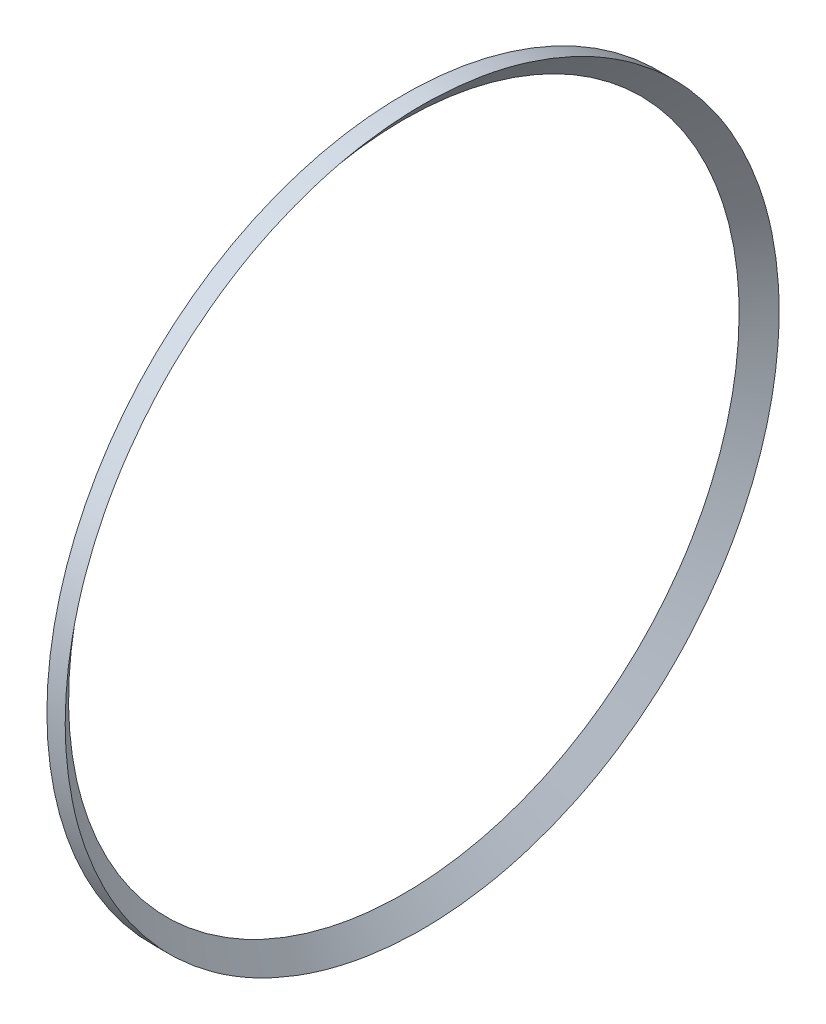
ISO-10303-21;
HEADER;
FILE_DESCRIPTION(('STEP AP214'),'2;1');
FILE_NAME('part.step','',(''),(''),'','','');
FILE_SCHEMA(('AUTOMOTIVE_DESIGN { 1 0 10303 214 1 1 1 1 }'));
ENDSEC;
DATA;
#1=APPLICATION_CONTEXT('core data for automotive mechanical design processes');
#2=APPLICATION_PROTOCOL_DEFINITION('international standard','automotive_design',2000,#1);
#3=PRODUCT_CONTEXT('',#1,'mechanical');
#4=PRODUCT('Part','Part','',(#3));
#5=PRODUCT_RELATED_PRODUCT_CATEGORY('part','',(#4));
#6=PRODUCT_DEFINITION_FORMATION('','',#4);
#7=PRODUCT_DEFINITION_CONTEXT('part definition',#1,'design');
#8=PRODUCT_DEFINITION('design','',#6,#7);
#9=PRODUCT_DEFINITION_SHAPE('','',#8);
#10=(LENGTH_UNIT() NAMED_UNIT(*) SI_UNIT(.MILLI.,.METRE.));
#11=(NAMED_UNIT(*) PLANE_ANGLE_UNIT() SI_UNIT($,.RADIAN.));
#12=(NAMED_UNIT(*) SI_UNIT($,.STERADIAN.) SOLID_ANGLE_UNIT());
#13=UNCERTAINTY_MEASURE_WITH_UNIT(LENGTH_MEASURE(1.E-05),#10,'distance_accuracy_value','');
#14=(GEOMETRIC_REPRESENTATION_CONTEXT(3) GLOBAL_UNCERTAINTY_ASSIGNED_CONTEXT((#13)) GLOBAL_UNIT_ASSIGNED_CONTEXT((#10,
#11,#12)) REPRESENTATION_CONTEXT('',''));
#15=CARTESIAN_POINT('',(0.,0.,0.));
#16=DIRECTION('',(0.,0.,1.));
#17=DIRECTION('',(1.,0.,0.));
#18=AXIS2_PLACEMENT_3D('',#15,#16,#17);
#19=CARTESIAN_POINT('',(66.9366133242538,109.912325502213,0.));
#20=DIRECTION('',(-1.,0.,0.));
#21=DIRECTION('',(0.,0.,1.));
#22=AXIS2_PLACEMENT_3D('',#19,#20,#21);
#23=PLANE('',#22);
#24=CARTESIAN_POINT('',(66.9366133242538,12.4123255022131,-91.5839202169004));
#25=CARTESIAN_POINT('',(66.9366133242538,11.0965458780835,-91.583919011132));
#26=CARTESIAN_POINT('',(66.9366133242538,9.7808341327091,-91.5552918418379));
#27=CARTESIAN_POINT('',(66.9366133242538,7.15219155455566,-91.4413851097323));
#28=CARTESIAN_POINT('',(66.9366133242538,5.83926006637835,-91.3561208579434));
#29=CARTESIAN_POINT('',(66.9366133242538,3.21855644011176,-91.1294235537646));
#30=CARTESIAN_POINT('',(66.9366133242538,1.91078326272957,-90.9880024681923));
#31=CARTESIAN_POINT('',(66.9366133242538,-0.697850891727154,-90.6492317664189));
#32=CARTESIAN_POINT('',(66.9366133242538,-1.99871014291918,-90.4518687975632));
#33=CARTESIAN_POINT('',(66.9366133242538,-4.13736580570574,-90.0801520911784));
#34=CARTESIAN_POINT('',(66.9366133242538,-4.97799088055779,-89.9218932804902));
#35=CARTESIAN_POINT('',(66.9366133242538,-6.65446167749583,-89.5817957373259));
#36=CARTESIAN_POINT('',(66.9366133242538,-7.49030731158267,-89.3999565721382));
#37=CARTESIAN_POINT('',(66.9366133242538,-9.99023236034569,-88.81914536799));
#38=CARTESIAN_POINT('',(66.9366133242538,-11.6462753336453,-88.3849533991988));
#39=CARTESIAN_POINT('',(66.9366133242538,-14.9314347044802,-87.4241976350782));
#40=CARTESIAN_POINT('',(66.9366133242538,-16.560548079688,-86.8976235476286));
#41=CARTESIAN_POINT('',(66.9366133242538,-19.7891112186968,-85.7532295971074));
#42=CARTESIAN_POINT('',(66.9366133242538,-21.3885141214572,-85.1352774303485));
#43=CARTESIAN_POINT('',(66.9366133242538,-24.5501483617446,-83.8110724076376));
#44=CARTESIAN_POINT('',(66.9366133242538,-26.1123830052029,-83.1048274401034));
#45=CARTESIAN_POINT('',(66.9366133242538,-29.1947463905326,-81.6057780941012));
#46=CARTESIAN_POINT('',(66.9366133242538,-30.7148768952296,-80.8129773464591));
#47=CARTESIAN_POINT('',(66.9366133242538,-33.3351011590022,-79.3512141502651));
#48=CARTESIAN_POINT('',(66.9366133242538,-34.4454850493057,-78.7006101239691));
#49=CARTESIAN_POINT('',(66.9366133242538,-36.6378258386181,-77.3529509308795));
#50=CARTESIAN_POINT('',(66.9366133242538,-37.7197810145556,-76.6558929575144));
#51=CARTESIAN_POINT('',(66.9366133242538,-39.8532613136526,-75.2166732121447));
#52=CARTESIAN_POINT('',(66.9366133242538,-40.9047862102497,-74.4745111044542));
#53=CARTESIAN_POINT('',(66.9366133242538,-42.9757545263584,-72.946724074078));
#54=CARTESIAN_POINT('',(66.9366133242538,-43.9951983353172,-72.1610996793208));
#55=CARTESIAN_POINT('',(66.9366133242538,-45.9999484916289,-70.5480941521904));
#56=CARTESIAN_POINT('',(66.9366133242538,-46.9852656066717,-69.7207263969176));
#57=CARTESIAN_POINT('',(66.9366133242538,-48.9203299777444,-68.0253038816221));
#58=CARTESIAN_POINT('',(66.9366133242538,-49.8700768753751,-67.1572487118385));
#59=CARTESIAN_POINT('',(66.9366133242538,-51.2664855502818,-65.8256772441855));
#60=CARTESIAN_POINT('',(66.9366133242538,-51.7272693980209,-65.3768884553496));
#61=CARTESIAN_POINT('',(66.9366133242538,-52.6391867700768,-64.4696114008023));
#62=CARTESIAN_POINT('',(66.9366133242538,-53.0903202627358,-64.0111231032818));
#63=CARTESIAN_POINT('',(66.9366133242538,-54.4289491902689,-62.6215357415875));
#64=CARTESIAN_POINT('',(66.9366133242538,-55.3017803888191,-61.6762118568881));
#65=CARTESIAN_POINT('',(66.9366133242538,-56.7227401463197,-60.0708271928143));
#66=CARTESIAN_POINT('',(66.9366133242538,-57.2821412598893,-59.4206884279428));
#67=CARTESIAN_POINT('',(66.9366133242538,-58.3825200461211,-58.1050698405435));
#68=CARTESIAN_POINT('',(66.9366133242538,-58.9234984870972,-57.4395906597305));
#69=CARTESIAN_POINT('',(66.9366133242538,-60.5182906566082,-55.4208076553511));
#70=CARTESIAN_POINT('',(66.9366133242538,-61.5440323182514,-54.0450780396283));
#71=CARTESIAN_POINT('',(66.9366133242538,-63.0233902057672,-51.9402161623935));
#72=CARTESIAN_POINT('',(66.9366133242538,-63.5066523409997,-51.2316877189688));
#73=CARTESIAN_POINT('',(66.9366133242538,-64.453007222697,-49.8012797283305));
#74=CARTESIAN_POINT('',(66.9366133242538,-64.9161000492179,-49.0794002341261));
#75=CARTESIAN_POINT('',(66.9366133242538,-66.2745835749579,-46.8945600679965));
#76=CARTESIAN_POINT('',(66.9366133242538,-67.1392330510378,-45.4123212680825));
#77=CARTESIAN_POINT('',(66.9366133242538,-68.7836524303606,-42.4016011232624));
#78=CARTESIAN_POINT('',(66.9366133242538,-69.5634216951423,-40.8731194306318));
#79=CARTESIAN_POINT('',(66.9366133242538,-71.0359884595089,-37.7747260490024));
#80=CARTESIAN_POINT('',(66.9366133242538,-71.7287851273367,-36.2048139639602));
#81=CARTESIAN_POINT('',(66.9366133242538,-72.8640928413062,-33.4241836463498));
#82=CARTESIAN_POINT('',(66.9366133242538,-73.3259785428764,-32.2213282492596));
#83=CARTESIAN_POINT('',(66.9366133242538,-74.1986748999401,-29.7971113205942));
#84=CARTESIAN_POINT('',(66.9366133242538,-74.609482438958,-28.5757486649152));
#85=CARTESIAN_POINT('',(66.9366133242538,-75.379095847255,-26.1168087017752));
#86=CARTESIAN_POINT('',(66.9366133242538,-75.7379037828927,-24.879232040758));
#87=CARTESIAN_POINT('',(66.9366133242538,-76.4028219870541,-22.3900021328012));
#88=CARTESIAN_POINT('',(66.9366133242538,-76.7089324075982,-21.1383489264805));
#89=CARTESIAN_POINT('',(66.9366133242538,-77.2678329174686,-18.6231823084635));
#90=CARTESIAN_POINT('',(66.9366133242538,-77.5206224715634,-17.359668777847));
#91=CARTESIAN_POINT('',(66.9366133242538,-77.9726615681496,-14.8230906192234));
#92=CARTESIAN_POINT('',(66.9366133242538,-78.1719105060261,-13.5500258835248));
#93=CARTESIAN_POINT('',(66.9366133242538,-78.5168153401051,-10.996657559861));
#94=CARTESIAN_POINT('',(66.9366133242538,-78.6624711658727,-9.71635396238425));
#95=CARTESIAN_POINT('',(66.9366133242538,-78.8999182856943,-7.15076773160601));
#96=CARTESIAN_POINT('',(66.9366133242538,-78.9917098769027,-5.86548512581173));
#97=CARTESIAN_POINT('',(66.9366133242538,-79.1210605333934,-3.29233079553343));
#98=CARTESIAN_POINT('',(66.9366133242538,-79.158625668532,-2.00445937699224));
#99=CARTESIAN_POINT('',(66.9366133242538,-79.178908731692,0.571714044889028));
#100=CARTESIAN_POINT('',(66.9366133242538,-79.1616268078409,1.86001604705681));
#101=CARTESIAN_POINT('',(66.9366133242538,-79.0726090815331,4.43472490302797));
#102=CARTESIAN_POINT('',(66.9366133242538,-79.0008734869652,5.7211317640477));
#103=CARTESIAN_POINT('',(66.9366133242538,-78.8034399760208,8.28980634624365));
#104=CARTESIAN_POINT('',(66.9366133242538,-78.6777415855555,9.57207403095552));
#105=CARTESIAN_POINT('',(66.9366133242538,-78.3726876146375,12.1301052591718));
#106=CARTESIAN_POINT('',(66.9366133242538,-78.1933364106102,13.4058693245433));
#107=CARTESIAN_POINT('',(66.9366133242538,-77.7811013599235,15.9488689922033));
#108=CARTESIAN_POINT('',(66.9366133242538,-77.5482115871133,17.2161036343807));
#109=CARTESIAN_POINT('',(66.9366133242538,-77.0289597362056,19.739564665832));
#110=CARTESIAN_POINT('',(66.9366133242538,-76.7425979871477,20.9957911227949));
#111=CARTESIAN_POINT('',(66.9366133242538,-76.1169803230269,23.494850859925));
#112=CARTESIAN_POINT('',(66.9366133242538,-75.7777303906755,24.737685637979));
#113=CARTESIAN_POINT('',(66.9366133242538,-75.0474871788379,27.206206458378));
#114=CARTESIAN_POINT('',(66.9366133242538,-74.6565654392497,28.4319136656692));
#115=CARTESIAN_POINT('',(66.9366133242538,-73.8234226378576,30.8657671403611));
#116=CARTESIAN_POINT('',(66.9366133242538,-73.3812014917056,32.0739133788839));
#117=CARTESIAN_POINT('',(66.9366133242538,-72.4464385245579,34.4705809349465));
#118=CARTESIAN_POINT('',(66.9366133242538,-71.9538965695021,35.6591022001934));
#119=CARTESIAN_POINT('',(66.9366133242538,-70.9193582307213,38.0144237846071));
#120=CARTESIAN_POINT('',(66.9366133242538,-70.3773618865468,39.1812241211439));
#121=CARTESIAN_POINT('',(66.9366133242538,-69.2446722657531,41.4909756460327));
#122=CARTESIAN_POINT('',(66.9366133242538,-68.6539780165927,42.6339263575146));
#123=CARTESIAN_POINT('',(66.9366133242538,-67.4248564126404,44.8938661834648));
#124=CARTESIAN_POINT('',(66.9366133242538,-66.7864291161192,46.0108553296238));
#125=CARTESIAN_POINT('',(66.9366133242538,-65.46292044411,48.2168473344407));
#126=CARTESIAN_POINT('',(66.9366133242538,-64.7778389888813,49.3058501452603));
#127=CARTESIAN_POINT('',(66.9366133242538,-63.36222520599,51.4539032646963));
#128=CARTESIAN_POINT('',(66.9366133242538,-62.6316927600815,52.5129534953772));
#129=CARTESIAN_POINT('',(66.9366133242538,-61.1265432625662,54.5997627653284));
#130=CARTESIAN_POINT('',(66.9366133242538,-60.3519120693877,55.6275116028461));
#131=CARTESIAN_POINT('',(66.9366133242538,-58.7602696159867,57.6496573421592));
#132=CARTESIAN_POINT('',(66.9366133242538,-57.943258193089,58.6440541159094));
#133=CARTESIAN_POINT('',(66.9366133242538,-56.2682354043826,60.5977014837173));
#134=CARTESIAN_POINT('',(66.9366133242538,-55.4102239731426,61.5569520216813));
#135=CARTESIAN_POINT('',(66.9366133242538,-53.6544579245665,63.4383550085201));
#136=CARTESIAN_POINT('',(66.9366133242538,-52.7567037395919,64.3605078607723));
#137=CARTESIAN_POINT('',(66.9366133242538,-50.9228022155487,66.1658137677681));
#138=CARTESIAN_POINT('',(66.9366133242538,-49.9866547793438,67.0489667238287));
#139=CARTESIAN_POINT('',(66.9366133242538,-48.0780239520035,68.7751079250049));
#140=CARTESIAN_POINT('',(66.9366133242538,-47.1055401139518,69.6180956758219));
#141=CARTESIAN_POINT('',(66.9366133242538,-45.1260899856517,71.2625627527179));
#142=CARTESIAN_POINT('',(66.9366133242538,-44.1191237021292,72.0640420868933));
#143=CARTESIAN_POINT('',(66.9366133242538,-42.0724923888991,73.6240920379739));
#144=CARTESIAN_POINT('',(66.9366133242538,-41.0328275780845,74.3826629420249));
#145=CARTESIAN_POINT('',(66.9366133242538,-38.9201491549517,75.8569216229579));
#146=CARTESIAN_POINT('',(66.9366133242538,-37.8470678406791,76.5725124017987));
#147=CARTESIAN_POINT('',(66.9366133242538,-35.6715124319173,77.9575265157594));
#148=CARTESIAN_POINT('',(66.9366133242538,-34.5690383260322,78.6269498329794));
#149=CARTESIAN_POINT('',(66.9366133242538,-32.3367194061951,79.9184923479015));
#150=CARTESIAN_POINT('',(66.9366133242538,-31.2068745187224,80.540611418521));
#151=CARTESIAN_POINT('',(66.9366133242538,-28.9218780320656,81.7365000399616));
#152=CARTESIAN_POINT('',(66.9366133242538,-27.7667263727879,82.3102694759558));
#153=CARTESIAN_POINT('',(66.9366133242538,-25.4332666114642,83.4085435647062));
#154=CARTESIAN_POINT('',(66.9366133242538,-24.2549589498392,83.9330491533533));
#155=CARTESIAN_POINT('',(66.9366133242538,-21.8773391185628,84.9320704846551));
#156=CARTESIAN_POINT('',(66.9366133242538,-20.6780269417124,85.4065862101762));
#157=CARTESIAN_POINT('',(66.9366133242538,-18.2604737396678,86.304638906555));
#158=CARTESIAN_POINT('',(66.9366133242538,-17.0422328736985,86.7281763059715));
#159=CARTESIAN_POINT('',(66.9366133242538,-14.5889351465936,87.5233654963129));
#160=CARTESIAN_POINT('',(66.9366133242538,-13.3538783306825,87.8950174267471));
#161=CARTESIAN_POINT('',(66.9366133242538,-10.8720288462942,88.5848773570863));
#162=CARTESIAN_POINT('',(66.9366133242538,-9.62527024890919,88.9032079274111));
#163=CARTESIAN_POINT('',(66.9366133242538,-7.11940198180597,89.486831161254));
#164=CARTESIAN_POINT('',(66.9366133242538,-5.86029233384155,89.7521239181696));
#165=CARTESIAN_POINT('',(66.9366133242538,-3.33199845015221,90.2293159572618));
#166=CARTESIAN_POINT('',(66.9366133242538,-2.06281419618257,90.441215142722));
#167=CARTESIAN_POINT('',(66.9366133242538,0.483333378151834,90.8116104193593));
#168=CARTESIAN_POINT('',(66.9366133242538,1.76029676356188,90.9701060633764));
#169=CARTESIAN_POINT('',(66.9366133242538,4.3197486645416,91.2334643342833));
#170=CARTESIAN_POINT('',(66.9366133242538,5.60223725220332,91.3383262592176));
#171=CARTESIAN_POINT('',(66.9366133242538,8.17051991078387,91.4940645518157));
#172=CARTESIAN_POINT('',(66.9366133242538,9.45631394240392,91.5449415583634));
#173=CARTESIAN_POINT('',(66.9366133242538,11.3856791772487,91.5803855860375));
#174=CARTESIAN_POINT('',(66.9366133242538,12.0289323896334,91.5853878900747));
#175=CARTESIAN_POINT('',(66.9366133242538,13.3153996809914,91.5817082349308));
#176=CARTESIAN_POINT('',(66.9366133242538,13.9586137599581,91.5730262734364));
#177=CARTESIAN_POINT('',(66.9366133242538,15.8877602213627,91.5265765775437));
#178=CARTESIAN_POINT('',(66.9366133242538,17.1732587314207,91.46840615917));
#179=CARTESIAN_POINT('',(66.9366133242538,19.7406718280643,91.2981304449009));
#180=CARTESIAN_POINT('',(66.9366133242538,21.0225863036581,91.1860234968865));
#181=CARTESIAN_POINT('',(66.9366133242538,23.5806037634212,90.9082092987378));
#182=CARTESIAN_POINT('',(66.9366133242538,24.8567067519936,90.7425020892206));
#183=CARTESIAN_POINT('',(66.9366133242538,27.4008327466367,90.357692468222));
#184=CARTESIAN_POINT('',(66.9366133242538,28.6688557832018,90.1385902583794));
#185=CARTESIAN_POINT('',(66.9366133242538,31.194509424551,89.6469975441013));
#186=CARTESIAN_POINT('',(66.9366133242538,32.4521400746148,89.3745072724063));
#187=CARTESIAN_POINT('',(66.9366133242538,34.9546636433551,88.7765890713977));
#188=CARTESIAN_POINT('',(66.9366133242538,36.1995574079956,88.4511646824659));
#189=CARTESIAN_POINT('',(66.9366133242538,38.6746267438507,87.7479768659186));
#190=CARTESIAN_POINT('',(66.9366133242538,39.9048006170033,87.3702074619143));
#191=CARTESIAN_POINT('',(66.9366133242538,42.348065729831,86.5631440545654));
#192=CARTESIAN_POINT('',(66.9366133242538,43.5611577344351,86.1338523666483));
#193=CARTESIAN_POINT('',(66.9366133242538,45.9682267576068,85.2246611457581));
#194=CARTESIAN_POINT('',(66.9366133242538,47.1622037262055,84.7447614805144));
#195=CARTESIAN_POINT('',(66.9366133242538,49.5306068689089,83.7346063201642));
#196=CARTESIAN_POINT('',(66.9366133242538,50.7050038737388,83.2042824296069));
#197=CARTESIAN_POINT('',(66.9366133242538,53.0303880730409,82.0945770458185));
#198=CARTESIAN_POINT('',(66.9366133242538,54.1813753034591,81.5151956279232));
#199=CARTESIAN_POINT('',(66.9366133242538,56.4578227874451,80.3083001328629));
#200=CARTESIAN_POINT('',(66.9366133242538,57.5832832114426,79.680786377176));
#201=CARTESIAN_POINT('',(66.9366133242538,59.806628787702,78.3786841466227));
#202=CARTESIAN_POINT('',(66.9366133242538,60.9045140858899,77.7040959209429));
#203=CARTESIAN_POINT('',(66.9366133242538,63.0707204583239,76.3089850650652));
#204=CARTESIAN_POINT('',(66.9366133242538,64.1390411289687,75.5884618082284));
#205=CARTESIAN_POINT('',(66.9366133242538,66.244363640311,74.1030188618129));
#206=CARTESIAN_POINT('',(66.9366133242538,67.2813652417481,73.338098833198));
#207=CARTESIAN_POINT('',(66.9366133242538,69.3223668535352,71.7654261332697));
#208=CARTESIAN_POINT('',(66.9366133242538,70.3263667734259,70.9576733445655));
#209=CARTESIAN_POINT('',(66.9366133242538,72.2995658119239,69.3007344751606));
#210=CARTESIAN_POINT('',(66.9366133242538,73.2687651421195,68.4515486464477));
#211=CARTESIAN_POINT('',(66.9366133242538,75.1702999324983,66.7132296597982));
#212=CARTESIAN_POINT('',(66.9366133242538,76.1026428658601,65.8241046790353));
#213=CARTESIAN_POINT('',(66.9366133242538,77.9286246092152,64.0069630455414));
#214=CARTESIAN_POINT('',(66.9366133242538,78.8222634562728,63.0789464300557));
#215=CARTESIAN_POINT('',(66.9366133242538,80.5695601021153,61.186025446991));
#216=CARTESIAN_POINT('',(66.9366133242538,81.4232180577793,60.2211212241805));
#217=CARTESIAN_POINT('',(66.9366133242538,83.0892776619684,58.2563194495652));
#218=CARTESIAN_POINT('',(66.9366133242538,83.9016790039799,57.256421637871));
#219=CARTESIAN_POINT('',(66.9366133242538,85.4838183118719,55.2234503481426));
#220=CARTESIAN_POINT('',(66.9366133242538,86.2535570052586,54.1903774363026));
#221=CARTESIAN_POINT('',(66.9366133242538,87.7488491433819,52.0927407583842));
#222=CARTESIAN_POINT('',(66.9366133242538,88.4744029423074,51.0281772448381));
#223=CARTESIAN_POINT('',(66.9366133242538,89.8797526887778,48.8692673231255));
#224=CARTESIAN_POINT('',(66.9366133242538,90.5595488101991,47.7749210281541));
#225=CARTESIAN_POINT('',(66.9366133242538,91.8722129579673,45.5584356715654));
#226=CARTESIAN_POINT('',(66.9366133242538,92.5050809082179,44.4362965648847));
#227=CARTESIAN_POINT('',(66.9366133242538,93.7219593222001,42.1678680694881));
#228=CARTESIAN_POINT('',(66.9366133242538,94.3060373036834,41.0216148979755));
#229=CARTESIAN_POINT('',(66.9366133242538,95.4253944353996,38.7055251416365));
#230=CARTESIAN_POINT('',(66.9366133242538,95.9606735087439,37.5356885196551));
#231=CARTESIAN_POINT('',(66.9366133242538,96.9816849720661,35.174589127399));
#232=CARTESIAN_POINT('',(66.9366133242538,97.4674172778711,33.9833263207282));
#233=CARTESIAN_POINT('',(66.9366133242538,98.3884244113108,31.5814513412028));
#234=CARTESIAN_POINT('',(66.9366133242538,98.8236992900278,30.3708391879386));
#235=CARTESIAN_POINT('',(66.9366133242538,99.6428448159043,27.9323200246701));
#236=CARTESIAN_POINT('',(66.9366133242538,100.026714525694,26.7044126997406));
#237=CARTESIAN_POINT('',(66.9366133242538,100.742255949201,24.2334833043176));
#238=CARTESIAN_POINT('',(66.9366133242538,101.073927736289,22.9904612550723));
#239=CARTESIAN_POINT('',(66.9366133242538,101.684415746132,20.4915000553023));
#240=CARTESIAN_POINT('',(66.9366133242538,101.963231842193,19.2355608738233));
#241=CARTESIAN_POINT('',(66.9366133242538,102.467519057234,16.7130178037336));
#242=CARTESIAN_POINT('',(66.9366133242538,102.692989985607,15.4464138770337));
#243=CARTESIAN_POINT('',(66.9366133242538,103.090657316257,12.9042917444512));
#244=CARTESIAN_POINT('',(66.9366133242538,103.262829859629,11.6287698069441));
#245=CARTESIAN_POINT('',(66.9366133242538,103.553585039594,9.07164075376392));
#246=CARTESIAN_POINT('',(66.9366133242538,103.672167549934,7.79003362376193));
#247=CARTESIAN_POINT('',(66.9366133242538,103.855420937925,5.22292224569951));
#248=CARTESIAN_POINT('',(66.9366133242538,103.920091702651,3.93741798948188));
#249=CARTESIAN_POINT('',(66.9366133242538,103.976322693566,2.0080579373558));
#250=CARTESIAN_POINT('',(66.9366133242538,103.988270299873,1.36473887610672));
#251=CARTESIAN_POINT('',(66.9366133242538,103.99848703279,0.0779922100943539));
#252=CARTESIAN_POINT('',(66.9366133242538,103.996756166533,-0.565435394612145));
#253=CARTESIAN_POINT('',(66.9366133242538,103.971084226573,-2.49543387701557));
#254=CARTESIAN_POINT('',(66.9366133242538,103.926665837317,-3.78178996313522));
#255=CARTESIAN_POINT('',(66.9366133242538,103.783770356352,-6.35146375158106));
#256=CARTESIAN_POINT('',(66.9366133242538,103.685292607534,-7.63478141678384));
#257=CARTESIAN_POINT('',(66.9366133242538,103.434637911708,-10.1961715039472));
#258=CARTESIAN_POINT('',(66.9366133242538,103.282460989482,-11.4742439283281));
#259=CARTESIAN_POINT('',(66.9366133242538,102.92465792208,-14.0228750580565));
#260=CARTESIAN_POINT('',(66.9366133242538,102.719032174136,-15.293433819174));
#261=CARTESIAN_POINT('',(66.9366133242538,102.253882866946,-17.8273303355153));
#262=CARTESIAN_POINT('',(66.9366133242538,101.994250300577,-19.0906480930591));
#263=CARTESIAN_POINT('',(66.9366133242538,101.421633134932,-21.6051352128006));
#264=CARTESIAN_POINT('',(66.9366133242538,101.108648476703,-22.8563045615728));
#265=CARTESIAN_POINT('',(66.9366133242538,100.429966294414,-25.3442675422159));
#266=CARTESIAN_POINT('',(66.9366133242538,100.064268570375,-26.5810611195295));
#267=CARTESIAN_POINT('',(66.9366133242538,99.2808985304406,-29.0380788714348));
#268=CARTESIAN_POINT('',(66.9366133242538,98.8632260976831,-30.2583030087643));
#269=CARTESIAN_POINT('',(66.9366133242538,97.9767965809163,-32.6800435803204));
#270=CARTESIAN_POINT('',(66.9366133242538,97.5080397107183,-33.8815600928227));
#271=CARTESIAN_POINT('',(66.9366133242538,96.520444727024,-36.2638316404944));
#272=CARTESIAN_POINT('',(66.9366133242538,96.0016066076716,-37.4445866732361));
#273=CARTESIAN_POINT('',(66.9366133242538,94.9145980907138,-39.7831567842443));
#274=CARTESIAN_POINT('',(66.9366133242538,94.3464281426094,-40.9409720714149));
#275=CARTESIAN_POINT('',(66.9366133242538,93.1616351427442,-43.2315379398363));
#276=CARTESIAN_POINT('',(66.9366133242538,92.5450122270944,-44.3642885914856));
#277=CARTESIAN_POINT('',(66.9366133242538,91.2657958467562,-46.600115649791));
#278=CARTESIAN_POINT('',(66.9366133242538,90.6033099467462,-47.7032535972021));
#279=CARTESIAN_POINT('',(66.9366133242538,89.2322473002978,-49.880503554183));
#280=CARTESIAN_POINT('',(66.9366133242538,88.5236706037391,-50.9546155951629));
#281=CARTESIAN_POINT('',(66.9366133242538,87.0618469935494,-53.071994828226));
#282=CARTESIAN_POINT('',(66.9366133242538,86.3086000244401,-54.115261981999));
#283=CARTESIAN_POINT('',(66.9366133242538,84.7590340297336,-56.1693158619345));
#284=CARTESIAN_POINT('',(66.9366133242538,83.9627146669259,-57.1801023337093));
#285=CARTESIAN_POINT('',(66.9366133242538,82.3285238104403,-59.1672981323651));
#286=CARTESIAN_POINT('',(66.9366133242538,81.4906571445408,-60.1437114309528));
#287=CARTESIAN_POINT('',(66.9366133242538,79.774589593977,-62.0604700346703));
#288=CARTESIAN_POINT('',(66.9366133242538,78.8963892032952,-63.0008157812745));
#289=CARTESIAN_POINT('',(66.9366133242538,77.5498254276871,-64.382713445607));
#290=CARTESIAN_POINT('',(66.9366133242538,77.0960793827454,-64.8385892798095));
#291=CARTESIAN_POINT('',(66.9366133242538,76.1790028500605,-65.7405965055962));
#292=CARTESIAN_POINT('',(66.9366133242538,75.7156723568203,-66.1867278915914));
#293=CARTESIAN_POINT('',(66.9366133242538,74.3117024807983,-67.510289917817));
#294=CARTESIAN_POINT('',(66.9366133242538,73.3570424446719,-68.3729317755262));
#295=CARTESIAN_POINT('',(66.9366133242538,71.4125044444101,-70.0572633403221));
#296=CARTESIAN_POINT('',(66.9366133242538,70.4226305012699,-70.8789576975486));
#297=CARTESIAN_POINT('',(66.9366133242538,68.4093347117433,-72.4801796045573));
#298=CARTESIAN_POINT('',(66.9366133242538,67.3859129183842,-73.2597072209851));
#299=CARTESIAN_POINT('',(66.9366133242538,65.3072641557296,-74.7751075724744));
#300=CARTESIAN_POINT('',(66.9366133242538,64.2520376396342,-75.5109809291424));
#301=CARTESIAN_POINT('',(66.9366133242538,62.1114220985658,-76.9374565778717));
#302=CARTESIAN_POINT('',(66.9366133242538,61.0260332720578,-77.6280591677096));
#303=CARTESIAN_POINT('',(66.9366133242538,58.8263171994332,-78.9631842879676));
#304=CARTESIAN_POINT('',(66.9366133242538,57.7119717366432,-79.6076768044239));
#305=CARTESIAN_POINT('',(66.9366133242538,55.4569260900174,-80.8490634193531));
#306=CARTESIAN_POINT('',(66.9366133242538,54.3162231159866,-81.4459524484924));
#307=CARTESIAN_POINT('',(66.9366133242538,52.0105921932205,-82.5911153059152));
#308=CARTESIAN_POINT('',(66.9366133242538,50.8456630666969,-83.1393867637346));
#309=CARTESIAN_POINT('',(66.9366133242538,48.4939170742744,-84.1864368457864));
#310=CARTESIAN_POINT('',(66.9366133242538,47.3071018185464,-84.6852190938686));
#311=CARTESIAN_POINT('',(66.9366133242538,44.326456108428,-85.8648627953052));
#312=CARTESIAN_POINT('',(66.9366133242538,42.5203905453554,-86.5150486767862));
#313=CARTESIAN_POINT('',(66.9366133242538,38.8706534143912,-87.7006139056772));
#314=CARTESIAN_POINT('',(66.9366133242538,37.0269772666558,-88.2359791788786));
#315=CARTESIAN_POINT('',(66.9366133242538,34.2390117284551,-88.9510632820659));
#316=CARTESIAN_POINT('',(66.9366133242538,33.3058109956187,-89.1747900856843));
#317=CARTESIAN_POINT('',(66.9366133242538,31.4327849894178,-89.592688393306));
#318=CARTESIAN_POINT('',(66.9366133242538,30.4929597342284,-89.7868599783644));
#319=CARTESIAN_POINT('',(66.9366133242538,28.6091717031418,-90.145212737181));
#320=CARTESIAN_POINT('',(66.9366133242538,27.6652179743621,-90.3094414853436));
#321=CARTESIAN_POINT('',(66.9366133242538,25.7726687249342,-90.6082929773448));
#322=CARTESIAN_POINT('',(66.9366133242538,24.8240732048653,-90.7429157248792));
#323=CARTESIAN_POINT('',(66.9366133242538,21.9729943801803,-91.1022444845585));
#324=CARTESIAN_POINT('',(66.9366133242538,20.0647201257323,-91.2825057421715));
#325=CARTESIAN_POINT('',(66.9366133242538,16.2416884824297,-91.5233123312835));
#326=CARTESIAN_POINT('',(66.9366133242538,14.3269351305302,-91.583921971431));
#327=CARTESIAN_POINT('',(66.9366133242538,12.4123255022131,-91.5839202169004));
#328=B_SPLINE_CURVE_WITH_KNOTS('',3,(#24,#25,#26,#27,#28,#29,#30,#31,#32,#33,#34,#35,#36,#37,
#38,#39,#40,#41,#42,#43,#44,#45,#46,#47,#48,#49,#50,#51,#52,#53,#54,#55,#56,#57,#58,#59,#60,#61,
#62,#63,#64,#65,#66,#67,#68,#69,#70,#71,#72,#73,#74,#75,#76,#77,#78,#79,#80,#81,#82,#83,#84,#85,
#86,#87,#88,#89,#90,#91,#92,#93,#94,#95,#96,#97,#98,#99,#100,#101,#102,#103,#104,#105,#106,#107,
#108,#109,#110,#111,#112,#113,#114,#115,#116,#117,#118,#119,#120,#121,#122,#123,#124,#125,#126,
#127,#128,#129,#130,#131,#132,#133,#134,#135,#136,#137,#138,#139,#140,#141,#142,#143,#144,#145,
#146,#147,#148,#149,#150,#151,#152,#153,#154,#155,#156,#157,#158,#159,#160,#161,#162,#163,#164,
#165,#166,#167,#168,#169,#170,#171,#172,#173,#174,#175,#176,#177,#178,#179,#180,#181,#182,#183,
#184,#185,#186,#187,#188,#189,#190,#191,#192,#193,#194,#195,#196,#197,#198,#199,#200,#201,#202,
#203,#204,#205,#206,#207,#208,#209,#210,#211,#212,#213,#214,#215,#216,#217,#218,#219,#220,#221,
#222,#223,#224,#225,#226,#227,#228,#229,#230,#231,#232,#233,#234,#235,#236,#237,#238,#239,#240,
#241,#242,#243,#244,#245,#246,#247,#248,#249,#250,#251,#252,#253,#254,#255,#256,#257,#258,#259,
#260,#261,#262,#263,#264,#265,#266,#267,#268,#269,#270,#271,#272,#273,#274,#275,#276,#277,#278,
#279,#280,#281,#282,#283,#284,#285,#286,#287,#288,#289,#290,#291,#292,#293,#294,#295,#296,#297,
#298,#299,#300,#301,#302,#303,#304,#305,#306,#307,#308,#309,#310,#311,#312,#313,#314,#315,#316,
#317,#318,#319,#320,#321,#322,#323,#324,#325,#326,#327),.UNSPECIFIED.,.T.,.F.,(4,2,2,2,2,2,2,2,
2,2,2,2,2,2,2,2,2,2,2,2,2,2,2,2,2,2,2,2,2,2,2,2,2,2,2,2,2,2,2,2,2,2,2,2,2,2,2,2,2,2,2,2,2,2,2,2,
2,2,2,2,2,2,2,2,2,2,2,2,2,2,2,2,2,2,2,2,2,2,2,2,2,2,2,2,2,2,2,2,2,2,2,2,2,2,2,2,2,2,2,2,2,2,2,2,
2,2,2,2,2,2,2,2,2,2,2,2,2,2,2,2,2,2,2,2,2,2,2,2,2,2,2,2,2,2,2,2,2,2,2,2,2,2,2,2,2,2,2,2,2,2,2,
4),(0.,3.94691838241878,7.89277020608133,11.83778163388,15.7837354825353,18.3495930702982,
20.9154977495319,26.0485981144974,31.1822707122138,36.3234503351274,41.4641709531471,
46.6046760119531,50.4644421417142,54.3244416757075,58.18446994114,62.0444513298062,
65.9032035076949,69.7619945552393,71.6915303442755,73.6210724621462,77.4797121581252,
80.052432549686,82.6250455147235,87.7699500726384,90.3426134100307,92.9152665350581,
98.0602928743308,103.205357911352,108.350472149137,112.214867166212,116.079497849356,
119.943974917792,123.808440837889,127.672945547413,131.53749389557,135.402047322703,
139.266579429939,143.130678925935,146.994767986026,150.858842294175,154.722950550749,
158.586743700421,162.450964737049,166.315161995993,170.17892245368,174.037388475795,
177.895860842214,181.7543434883,185.612823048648,189.471379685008,193.32993161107,
197.188490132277,201.047058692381,204.906871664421,208.76669945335,212.626533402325,
216.486325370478,220.346127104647,224.205976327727,228.065824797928,231.925647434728,
235.793876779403,239.66210762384,243.530348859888,247.398599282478,251.266776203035,
255.134954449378,259.00310017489,262.871235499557,266.730353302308,270.58946430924,
274.448582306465,278.307732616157,282.166933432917,286.026088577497,287.955780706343,
289.885473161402,293.744672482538,297.603990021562,301.463304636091,305.322604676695,
309.181887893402,313.040913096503,316.900379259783,320.759672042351,324.618974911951,
328.483589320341,332.348197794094,336.212780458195,340.077342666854,343.941957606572,
347.806602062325,351.671257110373,355.535888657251,359.399732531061,363.263572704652,
367.127397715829,370.991251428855,374.855039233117,378.718796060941,382.582538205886,
386.446286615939,390.304596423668,394.162912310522,398.021234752,401.879553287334,
405.737942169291,409.596325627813,413.45471833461,417.313124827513,421.173256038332,
425.033396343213,428.893544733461,430.823709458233,432.753873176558,436.613992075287,
440.47415789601,444.33432193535,448.194457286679,452.062460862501,455.930468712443,
459.798491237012,463.666522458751,467.534537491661,471.402552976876,475.270533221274,
479.138502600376,482.997688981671,486.8568711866,490.716058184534,494.57527540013,
498.434045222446,502.292767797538,504.222246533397,506.151726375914,510.010504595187,
513.868843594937,517.727176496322,521.585454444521,525.443707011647,529.304448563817,
533.165600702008,537.026940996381,540.887998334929,546.642694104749,552.398094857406,
555.276630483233,558.155158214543,561.029071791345,563.902985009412,569.649291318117,
575.392508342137),.UNSPECIFIED.);
#329=CARTESIAN_POINT('',(66.9366133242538,12.4123255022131,-91.5839202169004));
#330=VERTEX_POINT('',#329);
#331=EDGE_CURVE('E62',#330,#330,#328,.T.);
#332=ORIENTED_EDGE('',*,*,#331,.F.);
#333=EDGE_LOOP('',(#332));
#334=FACE_BOUND('',#333,.T.);
#335=CARTESIAN_POINT('',(66.9366133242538,12.4123255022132,0.));
#336=DIRECTION('',(-1.,0.,0.));
#337=DIRECTION('',(0.,0.,1.));
#338=AXIS2_PLACEMENT_3D('',#335,#336,#337);
#339=CIRCLE('',#338,97.5);
#340=CARTESIAN_POINT('',(66.9366133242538,12.4123255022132,97.5));
#341=VERTEX_POINT('',#340);
#342=EDGE_CURVE('E72',#341,#341,#339,.F.);
#343=ORIENTED_EDGE('',*,*,#342,.F.);
#344=EDGE_LOOP('',(#343));
#345=FACE_BOUND('',#344,.T.);
#346=ADVANCED_FACE('F55',(#334,#345),#23,.T.);
#347=CARTESIAN_POINT('',(51.9366133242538,12.4123255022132,0.));
#348=DIRECTION('',(-1.,0.,0.));
#349=DIRECTION('',(0.,0.,1.));
#350=AXIS2_PLACEMENT_3D('',#347,#348,#349);
#351=CYLINDRICAL_SURFACE('',#350,97.5);
#352=CARTESIAN_POINT('',(71.9366133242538,12.4123255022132,-97.5));
#353=CARTESIAN_POINT('',(71.9366127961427,13.7130288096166,-97.4999996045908));
#354=CARTESIAN_POINT('',(71.9368236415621,15.0137527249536,-97.4739676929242));
#355=CARTESIAN_POINT('',(71.9372722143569,17.6131712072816,-97.3698788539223));
#356=CARTESIAN_POINT('',(71.9375099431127,18.9118656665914,-97.291819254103));
#357=CARTESIAN_POINT('',(71.9377897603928,21.5065036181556,-97.0836831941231));
#358=CARTESIAN_POINT('',(71.9378316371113,22.8024426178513,-96.9535505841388));
#359=CARTESIAN_POINT('',(71.9376589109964,25.3882270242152,-96.6414627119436));
#360=CARTESIAN_POINT('',(71.9374442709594,26.678071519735,-96.4594999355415));
#361=CARTESIAN_POINT('',(71.9368177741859,29.6983281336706,-95.971509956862));
#362=CARTESIAN_POINT('',(71.9363632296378,31.4253692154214,-95.6443476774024));
#363=CARTESIAN_POINT('',(71.9358337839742,34.8598422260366,-94.8970439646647));
#364=CARTESIAN_POINT('',(71.9357590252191,36.5672665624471,-94.4768677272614));
#365=CARTESIAN_POINT('',(71.9358494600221,39.9570739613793,-93.544785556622));
#366=CARTESIAN_POINT('',(71.9360146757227,41.6394546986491,-93.0328711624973));
#367=CARTESIAN_POINT('',(71.9364228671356,44.975973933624,-91.9182029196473));
#368=CARTESIAN_POINT('',(71.9366659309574,46.6300781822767,-91.3153465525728));
#369=CARTESIAN_POINT('',(71.9368236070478,49.9030832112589,-90.0210522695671));
#370=CARTESIAN_POINT('',(71.9367382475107,51.5219870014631,-89.3296219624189));
#371=CARTESIAN_POINT('',(71.9364059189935,54.7200387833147,-87.8601381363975));
#372=CARTESIAN_POINT('',(71.9361589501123,56.2991867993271,-87.0820846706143));
#373=CARTESIAN_POINT('',(71.9358681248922,59.0686958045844,-85.6230813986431));
#374=CARTESIAN_POINT('',(71.9357914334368,60.2678204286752,-84.9586974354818));
#375=CARTESIAN_POINT('',(71.935795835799,62.6370967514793,-83.5799075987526));
#376=CARTESIAN_POINT('',(71.935876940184,63.8072465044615,-82.8654983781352));
#377=CARTESIAN_POINT('',(71.9362676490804,66.1164070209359,-81.3879632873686));
#378=CARTESIAN_POINT('',(71.9365772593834,67.2554169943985,-80.6248361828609));
#379=CARTESIAN_POINT('',(71.9371832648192,69.500229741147,-79.0512490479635));
#380=CARTESIAN_POINT('',(71.9374796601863,70.6060331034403,-78.2407898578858));
#381=CARTESIAN_POINT('',(71.9378029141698,72.7822921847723,-76.5741162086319));
#382=CARTESIAN_POINT('',(71.9378298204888,73.8527541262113,-75.7179098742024));
#383=CARTESIAN_POINT('',(71.9376373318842,75.9566377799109,-73.9611285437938));
#384=CARTESIAN_POINT('',(71.9374179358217,76.9900593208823,-73.0605533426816));
#385=CARTESIAN_POINT('',(71.9369317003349,79.0180052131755,-71.2166521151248));
#386=CARTESIAN_POINT('',(71.9366648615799,80.0125301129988,-70.2733266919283));
#387=CARTESIAN_POINT('',(71.9365837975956,81.9609289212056,-68.345591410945));
#388=CARTESIAN_POINT('',(71.9367695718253,82.9148028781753,-67.3611816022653));
#389=CARTESIAN_POINT('',(71.9372201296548,84.7802732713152,-65.3529533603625));
#390=CARTESIAN_POINT('',(71.9374849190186,85.6918666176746,-64.3291320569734));
#391=CARTESIAN_POINT('',(71.9377925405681,87.4710809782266,-62.2439684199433));
#392=CARTESIAN_POINT('',(71.9378353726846,88.3387019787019,-61.1826260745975));
#393=CARTESIAN_POINT('',(71.9376412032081,90.0283822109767,-59.0243671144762));
#394=CARTESIAN_POINT('',(71.9374042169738,90.8504439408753,-57.9274524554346));
#395=CARTESIAN_POINT('',(71.9368198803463,92.447687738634,-55.69981505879));
#396=CARTESIAN_POINT('',(71.9364725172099,93.2228643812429,-54.5690884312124));
#397=CARTESIAN_POINT('',(71.9359917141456,94.7248773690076,-52.2759267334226));
#398=CARTESIAN_POINT('',(71.9358582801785,95.4517123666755,-51.1134907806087));
#399=CARTESIAN_POINT('',(71.9357673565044,96.8556449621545,-48.7591435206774));
#400=CARTESIAN_POINT('',(71.9358098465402,97.5327482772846,-47.5672356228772));
#401=CARTESIAN_POINT('',(71.9360086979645,98.8361430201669,-45.1558662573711));
#402=CARTESIAN_POINT('',(71.9361650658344,99.4624315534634,-43.936403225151));
#403=CARTESIAN_POINT('',(71.936488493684,100.66304016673,-41.472157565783));
#404=CARTESIAN_POINT('',(71.9366555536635,101.237360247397,-40.227374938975));
#405=CARTESIAN_POINT('',(71.9368068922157,102.333003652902,-37.714719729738));
#406=CARTESIAN_POINT('',(71.9367911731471,102.85432766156,-36.4468474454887));
#407=CARTESIAN_POINT('',(71.9366020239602,103.843060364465,-33.8902517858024));
#408=CARTESIAN_POINT('',(71.9364285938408,104.310469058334,-32.6015284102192));
#409=CARTESIAN_POINT('',(71.9361077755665,105.190540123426,-30.0055217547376));
#410=CARTESIAN_POINT('',(71.9359603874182,105.603202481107,-28.6982384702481));
#411=CARTESIAN_POINT('',(71.9357892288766,106.373046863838,-26.0674372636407));
#412=CARTESIAN_POINT('',(71.9357654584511,106.730228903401,-24.7439193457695));
#413=CARTESIAN_POINT('',(71.9359029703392,107.388476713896,-22.0830054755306));
#414=CARTESIAN_POINT('',(71.9360642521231,107.689542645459,-20.7456095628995));
#415=CARTESIAN_POINT('',(71.9365816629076,108.235024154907,-18.0593151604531));
#416=CARTESIAN_POINT('',(71.9369377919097,108.479439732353,-16.7104166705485));
#417=CARTESIAN_POINT('',(71.9374990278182,108.911185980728,-14.0035115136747));
#418=CARTESIAN_POINT('',(71.9377041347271,109.098516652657,-12.6455048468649));
#419=CARTESIAN_POINT('',(71.9378311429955,109.415759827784,-9.92281327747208));
#420=CARTESIAN_POINT('',(71.9377530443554,109.545672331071,-8.55812837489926));
#421=CARTESIAN_POINT('',(71.9374037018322,109.747848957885,-5.82444755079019));
#422=CARTESIAN_POINT('',(71.9371324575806,109.820112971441,-4.45545162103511));
#423=CARTESIAN_POINT('',(71.9368008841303,109.885175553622,-2.40067306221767));
#424=CARTESIAN_POINT('',(71.9367029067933,109.899640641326,-1.71551372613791));
#425=CARTESIAN_POINT('',(71.9366060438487,109.914123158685,-0.345042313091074));
#426=CARTESIAN_POINT('',(71.9366071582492,109.914140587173,0.340269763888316));
#427=CARTESIAN_POINT('',(71.936748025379,109.892515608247,2.3959644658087));
#428=CARTESIAN_POINT('',(71.9370252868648,109.849198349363,3.76618180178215));
#429=CARTESIAN_POINT('',(71.9374996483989,109.704836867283,6.50352726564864));
#430=CARTESIAN_POINT('',(71.937696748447,109.603792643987,7.87065539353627));
#431=CARTESIAN_POINT('',(71.9378310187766,109.344157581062,10.599447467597));
#432=CARTESIAN_POINT('',(71.9377681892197,109.185566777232,11.9611114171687));
#433=CARTESIAN_POINT('',(71.9373857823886,108.811120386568,14.676539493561));
#434=CARTESIAN_POINT('',(71.9370662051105,108.595264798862,16.0303036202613));
#435=CARTESIAN_POINT('',(71.9364628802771,108.106672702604,18.7275289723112));
#436=CARTESIAN_POINT('',(71.9361791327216,107.833936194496,20.0709901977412));
#437=CARTESIAN_POINT('',(71.935836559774,107.232067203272,22.7452198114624));
#438=CARTESIAN_POINT('',(71.9357777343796,106.902934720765,24.0759881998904));
#439=CARTESIAN_POINT('',(71.9358139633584,106.188858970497,26.7224663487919));
#440=CARTESIAN_POINT('',(71.9359090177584,105.803915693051,28.0381761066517));
#441=CARTESIAN_POINT('',(71.9361782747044,104.978902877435,30.6521971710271));
#442=CARTESIAN_POINT('',(71.9363524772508,104.538833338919,31.9505084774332));
#443=CARTESIAN_POINT('',(71.9366524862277,103.604350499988,34.5274240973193));
#444=CARTESIAN_POINT('',(71.9367782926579,103.109937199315,35.806028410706));
#445=CARTESIAN_POINT('',(71.9368006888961,102.067645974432,38.341256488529));
#446=CARTESIAN_POINT('',(71.9366972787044,101.519768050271,39.5978802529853));
#447=CARTESIAN_POINT('',(71.9364168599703,100.371521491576,42.0869134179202));
#448=CARTESIAN_POINT('',(71.9362398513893,99.771152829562,43.319322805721));
#449=CARTESIAN_POINT('',(71.9359525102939,98.5189925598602,45.7577351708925));
#450=CARTESIAN_POINT('',(71.9358421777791,97.8672009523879,46.9637381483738));
#451=CARTESIAN_POINT('',(71.9357686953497,96.513353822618,49.3471931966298));
#452=CARTESIAN_POINT('',(71.9358055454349,95.8112983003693,50.5246452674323));
#453=CARTESIAN_POINT('',(71.9360967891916,94.3581714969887,52.848905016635));
#454=CARTESIAN_POINT('',(71.9363511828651,93.607100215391,53.9957126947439));
#455=CARTESIAN_POINT('',(71.9369439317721,92.0572784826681,56.2566432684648));
#456=CARTESIAN_POINT('',(71.9372822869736,91.2585280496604,57.3707661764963));
#457=CARTESIAN_POINT('',(71.937719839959,89.6147651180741,59.5643495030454));
#458=CARTESIAN_POINT('',(71.937819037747,88.7697526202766,60.6438099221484));
#459=CARTESIAN_POINT('',(71.9377472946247,87.0349789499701,62.7661381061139));
#460=CARTESIAN_POINT('',(71.937576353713,86.1452177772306,63.8090058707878));
#461=CARTESIAN_POINT('',(71.9371219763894,84.3224884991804,65.856334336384));
#462=CARTESIAN_POINT('',(71.9368385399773,83.3895203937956,66.8607950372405));
#463=CARTESIAN_POINT('',(71.936631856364,81.9589938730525,68.3372566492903));
#464=CARTESIAN_POINT('',(71.9365993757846,81.4769588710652,68.8243853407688));
#465=CARTESIAN_POINT('',(71.9366489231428,80.502726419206,69.7883722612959));
#466=CARTESIAN_POINT('',(71.9367309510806,80.0105289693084,70.2652304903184));
#467=CARTESIAN_POINT('',(71.9370345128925,78.519026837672,71.6800679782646));
#468=CARTESIAN_POINT('',(71.9373135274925,77.5047593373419,72.6023647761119));
#469=CARTESIAN_POINT('',(71.9377037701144,75.4382762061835,74.4033478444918));
#470=CARTESIAN_POINT('',(71.9378149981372,74.3860605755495,75.2820341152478));
#471=CARTESIAN_POINT('',(71.9377554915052,72.245511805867,76.994273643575));
#472=CARTESIAN_POINT('',(71.9375847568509,71.157178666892,77.8278269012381));
#473=CARTESIAN_POINT('',(71.9370564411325,68.9463413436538,79.4483072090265));
#474=CARTESIAN_POINT('',(71.9366988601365,67.8238371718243,80.2352342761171));
#475=CARTESIAN_POINT('',(71.9361497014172,65.5466504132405,81.7610661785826));
#476=CARTESIAN_POINT('',(71.9359581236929,64.3919678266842,82.4999710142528));
#477=CARTESIAN_POINT('',(71.9357707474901,62.0524782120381,83.9284437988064));
#478=CARTESIAN_POINT('',(71.9357749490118,60.8676711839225,84.6180117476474));
#479=CARTESIAN_POINT('',(71.9359157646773,58.4700392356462,85.9465848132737));
#480=CARTESIAN_POINT('',(71.9360523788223,57.2572143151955,86.5855899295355));
#481=CARTESIAN_POINT('',(71.9363660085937,54.8057031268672,87.8119010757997));
#482=CARTESIAN_POINT('',(71.936543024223,53.5670168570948,88.3992071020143));
#483=CARTESIAN_POINT('',(71.9367671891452,51.0659855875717,89.521075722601));
#484=CARTESIAN_POINT('',(71.9368143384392,49.8036405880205,90.0556383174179));
#485=CARTESIAN_POINT('',(71.9367042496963,47.2575365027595,91.071069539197));
#486=CARTESIAN_POINT('',(71.9365470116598,45.9737774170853,91.5519381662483));
#487=CARTESIAN_POINT('',(71.9362258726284,43.3871278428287,92.4591264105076));
#488=CARTESIAN_POINT('',(71.9360619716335,42.0842373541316,92.8854460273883));
#489=CARTESIAN_POINT('',(71.9358371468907,39.4616409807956,93.6827784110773));
#490=CARTESIAN_POINT('',(71.9357762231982,38.1419350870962,94.0537911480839));
#491=CARTESIAN_POINT('',(71.9358222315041,35.4880552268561,94.7398497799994));
#492=CARTESIAN_POINT('',(71.935929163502,34.1538812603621,95.0548956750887));
#493=CARTESIAN_POINT('',(71.936367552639,31.4734376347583,95.628460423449));
#494=CARTESIAN_POINT('',(71.936699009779,30.1271679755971,95.8869792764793));
#495=CARTESIAN_POINT('',(71.9372985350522,27.4249267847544,96.3470302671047));
#496=CARTESIAN_POINT('',(71.9375666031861,26.0689552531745,96.5485624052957));
#497=CARTESIAN_POINT('',(71.9378258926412,23.3497214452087,96.8942816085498));
#498=CARTESIAN_POINT('',(71.9378171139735,21.9864591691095,97.0384686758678));
#499=CARTESIAN_POINT('',(71.9375648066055,19.2550679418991,97.2692413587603));
#500=CARTESIAN_POINT('',(71.9373212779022,17.8869389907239,97.3558269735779));
#501=CARTESIAN_POINT('',(71.9368453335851,15.1482471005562,97.4712427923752));
#502=CARTESIAN_POINT('',(71.9366129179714,13.7776841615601,97.5000729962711));
#503=CARTESIAN_POINT('',(71.9366137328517,11.0365613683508,97.4999267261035));
#504=CARTESIAN_POINT('',(71.9368469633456,9.66600151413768,97.4709502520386));
#505=CARTESIAN_POINT('',(71.9373232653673,6.92732205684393,97.3552421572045));
#506=CARTESIAN_POINT('',(71.9375663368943,5.55920245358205,97.2685105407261));
#507=CARTESIAN_POINT('',(71.9378174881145,2.8278360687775,97.0374463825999));
#508=CARTESIAN_POINT('',(71.9378255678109,1.46458928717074,96.8931138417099));
#509=CARTESIAN_POINT('',(71.9375649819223,-1.25460735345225,96.5471044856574));
#510=CARTESIAN_POINT('',(71.9372963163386,-2.61055721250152,96.3454276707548));
#511=CARTESIAN_POINT('',(71.9366965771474,-5.31274897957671,95.8850883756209));
#512=CARTESIAN_POINT('',(71.9363655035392,-6.6589908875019,95.6264258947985));
#513=CARTESIAN_POINT('',(71.9359280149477,-9.33937306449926,95.0525751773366));
#514=CARTESIAN_POINT('',(71.9358215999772,-10.6735133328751,94.7373869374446));
#515=CARTESIAN_POINT('',(71.9357764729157,-13.3273198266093,94.0510451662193));
#516=CARTESIAN_POINT('',(71.9358377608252,-14.6469860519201,93.6798916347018));
#517=CARTESIAN_POINT('',(71.9360630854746,-17.2694978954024,92.8822792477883));
#518=CARTESIAN_POINT('',(71.9362271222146,-18.572343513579,92.4558203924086));
#519=CARTESIAN_POINT('',(71.9365481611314,-21.158897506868,91.5483556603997));
#520=CARTESIAN_POINT('',(71.9367051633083,-22.442605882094,91.0673497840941));
#521=CARTESIAN_POINT('',(71.9368143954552,-24.9886028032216,90.0516462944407));
#522=CARTESIAN_POINT('',(71.9367666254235,-26.2508913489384,89.5169486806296));
#523=CARTESIAN_POINT('',(71.9365417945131,-28.7518040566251,88.3948124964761));
#524=CARTESIAN_POINT('',(71.9363647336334,-29.9904282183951,87.8073739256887));
#525=CARTESIAN_POINT('',(71.936051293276,-32.4418097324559,86.5808003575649));
#526=CARTESIAN_POINT('',(71.9359149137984,-33.6545670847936,85.9416653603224));
#527=CARTESIAN_POINT('',(71.9357747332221,-36.0520584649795,84.6128354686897));
#528=CARTESIAN_POINT('',(71.9357709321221,-37.2367924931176,83.9231405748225));
#529=CARTESIAN_POINT('',(71.9359593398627,-39.5761305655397,82.4944172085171));
#530=CARTESIAN_POINT('',(71.9361515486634,-40.7307346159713,81.7553887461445));
#531=CARTESIAN_POINT('',(71.9367012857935,-43.0077591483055,80.2293129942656));
#532=CARTESIAN_POINT('',(71.9370588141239,-44.1301796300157,79.442265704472));
#533=CARTESIAN_POINT('',(71.9375863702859,-46.3408441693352,77.8215488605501));
#534=CARTESIAN_POINT('',(71.9377563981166,-47.4290882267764,76.9878793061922));
#535=CARTESIAN_POINT('',(71.9378145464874,-49.5694540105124,75.2754110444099));
#536=CARTESIAN_POINT('',(71.937702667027,-50.6215757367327,74.3966123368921));
#537=CARTESIAN_POINT('',(71.937311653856,-52.6878663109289,72.5954085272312));
#538=CARTESIAN_POINT('',(71.9370325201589,-53.7020351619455,71.6730034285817));
#539=CARTESIAN_POINT('',(71.9367296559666,-55.1933859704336,70.2580066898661));
#540=CARTESIAN_POINT('',(71.9366480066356,-55.6855324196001,69.7810959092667));
#541=CARTESIAN_POINT('',(71.9365994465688,-56.6596617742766,68.8170049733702));
#542=CARTESIAN_POINT('',(71.9366325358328,-57.1416446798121,68.3298248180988));
#543=CARTESIAN_POINT('',(71.9368404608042,-58.5720130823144,66.8532107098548));
#544=CARTESIAN_POINT('',(71.937123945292,-59.504873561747,65.8486506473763));
#545=CARTESIAN_POINT('',(71.9375778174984,-61.3273835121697,63.8011280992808));
#546=CARTESIAN_POINT('',(71.9377482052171,-62.2170329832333,62.7581656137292));
#547=CARTESIAN_POINT('',(71.9378186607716,-63.9515798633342,60.6356521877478));
#548=CARTESIAN_POINT('',(71.9377187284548,-64.7964772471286,59.5561012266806));
#549=CARTESIAN_POINT('',(71.9372801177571,-66.4400062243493,57.3623417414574));
#550=CARTESIAN_POINT('',(71.9369414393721,-67.2386378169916,56.2481332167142));
#551=CARTESIAN_POINT('',(71.9363489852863,-68.788218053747,53.9870369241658));
#552=CARTESIAN_POINT('',(71.9360952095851,-69.539166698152,52.8401491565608));
#553=CARTESIAN_POINT('',(71.9358050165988,-70.9920449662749,50.515734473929));
#554=CARTESIAN_POINT('',(71.9357685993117,-71.6939745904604,49.3382075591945));
#555=CARTESIAN_POINT('',(71.9358428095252,-73.0475671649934,46.9546077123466));
#556=CARTESIAN_POINT('',(71.9359534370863,-73.6992300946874,45.7485347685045));
#557=CARTESIAN_POINT('',(71.9362411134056,-74.9511301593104,43.3099879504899));
#558=CARTESIAN_POINT('',(71.9364181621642,-75.5513672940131,42.0775140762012));
#559=CARTESIAN_POINT('',(71.9366981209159,-76.6993484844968,39.58835687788));
#560=CARTESIAN_POINT('',(71.9368010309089,-77.2470925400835,38.331673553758));
#561=CARTESIAN_POINT('',(71.9367777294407,-78.2891135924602,35.79633203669));
#562=CARTESIAN_POINT('',(71.9366515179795,-78.7833905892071,34.5176738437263));
#563=CARTESIAN_POINT('',(71.9363511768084,-79.7175980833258,31.9406577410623));
#564=CARTESIAN_POINT('',(71.9361770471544,-80.157528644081,30.6422998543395));
#565=CARTESIAN_POINT('',(71.9359081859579,-80.9822616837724,28.0281915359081));
#566=CARTESIAN_POINT('',(71.9358134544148,-81.3670641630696,26.7124411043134));
#567=CARTESIAN_POINT('',(71.9357780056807,-82.0808568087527,24.0658873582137));
#568=CARTESIAN_POINT('',(71.9358372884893,-82.4098469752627,22.735084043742));
#569=CARTESIAN_POINT('',(71.9361808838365,-83.0114299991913,20.0607906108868));
#570=CARTESIAN_POINT('',(71.9364651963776,-83.2840228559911,18.7173004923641));
#571=CARTESIAN_POINT('',(71.9370686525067,-83.7723266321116,16.0200230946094));
#572=CARTESIAN_POINT('',(71.9373877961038,-83.9880375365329,14.6662358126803));
#573=CARTESIAN_POINT('',(71.9377690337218,-84.3621937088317,11.9507675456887));
#574=CARTESIAN_POINT('',(71.9378311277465,-84.5206389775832,10.5890865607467));
#575=CARTESIAN_POINT('',(71.9376956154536,-84.7799822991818,7.86026740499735));
#576=CARTESIAN_POINT('',(71.9374980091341,-84.8808803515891,6.49312923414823));
#577=CARTESIAN_POINT('',(71.937023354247,-85.0249492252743,3.75576985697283));
#578=CARTESIAN_POINT('',(71.9367463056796,-85.0681200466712,2.38554865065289));
#579=CARTESIAN_POINT('',(71.9366068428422,-85.0895253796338,0.329852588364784));
#580=CARTESIAN_POINT('',(71.9366063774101,-85.0894347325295,-0.355459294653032));
#581=CARTESIAN_POINT('',(71.9367041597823,-85.0748058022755,-1.72592877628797));
#582=CARTESIAN_POINT('',(71.9368024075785,-85.0602675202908,-2.41108637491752));
#583=CARTESIAN_POINT('',(71.9371344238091,-84.9949854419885,-4.46585740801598));
#584=CARTESIAN_POINT('',(71.9374054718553,-84.9225752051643,-5.83484523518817));
#585=CARTESIAN_POINT('',(71.9377539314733,-84.7201064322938,-8.56850628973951));
#586=CARTESIAN_POINT('',(71.9378313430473,-84.590047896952,-9.93317951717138));
#587=CARTESIAN_POINT('',(71.9377029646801,-84.2725131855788,-12.6558415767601));
#588=CARTESIAN_POINT('',(71.9374971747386,-84.0850370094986,-14.0138304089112));
#589=CARTESIAN_POINT('',(71.9369353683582,-83.6530022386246,-16.7206831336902));
#590=CARTESIAN_POINT('',(71.9365793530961,-83.4084440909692,-18.0695470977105));
#591=CARTESIAN_POINT('',(71.9360626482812,-82.8626793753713,-20.7557665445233));
#592=CARTESIAN_POINT('',(71.9359019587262,-82.5614728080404,-22.0931220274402));
#593=CARTESIAN_POINT('',(71.9357654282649,-81.9029468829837,-24.7539452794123));
#594=CARTESIAN_POINT('',(71.9357895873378,-81.5456275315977,-26.0774130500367));
#595=CARTESIAN_POINT('',(71.9359613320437,-80.7755112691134,-28.7081083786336));
#596=CARTESIAN_POINT('',(71.9361089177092,-80.3627143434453,-30.0153359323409));
#597=CARTESIAN_POINT('',(71.9364298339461,-79.4823707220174,-32.6112445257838));
#598=CARTESIAN_POINT('',(71.9366031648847,-79.0148232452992,-33.899925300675));
#599=CARTESIAN_POINT('',(71.9367915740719,-78.025814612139,-36.4564298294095));
#600=CARTESIAN_POINT('',(71.9368066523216,-77.5043534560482,-37.7242535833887));
#601=CARTESIAN_POINT('',(71.936654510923,-76.4084447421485,-40.2367895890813));
#602=CARTESIAN_POINT('',(71.9364872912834,-75.8339971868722,-41.4815018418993));
#603=CARTESIAN_POINT('',(71.9361638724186,-74.6331371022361,-43.9456016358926));
#604=CARTESIAN_POINT('',(71.9360076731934,-74.0067245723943,-45.1649891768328));
#605=CARTESIAN_POINT('',(71.9358093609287,-72.7030561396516,-47.5762569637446));
#606=CARTESIAN_POINT('',(71.9357672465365,-72.0258008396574,-48.7681375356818));
#607=CARTESIAN_POINT('',(71.9358591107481,-70.6215636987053,-51.1224226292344));
#608=CARTESIAN_POINT('',(71.9359931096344,-69.8945761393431,-52.2848237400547));
#609=CARTESIAN_POINT('',(71.9364747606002,-68.3922364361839,-54.5779408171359));
#610=CARTESIAN_POINT('',(71.9368224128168,-67.6168842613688,-55.7086567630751));
#611=CARTESIAN_POINT('',(71.9374063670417,-66.0192869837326,-57.9362631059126));
#612=CARTESIAN_POINT('',(71.9376426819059,-65.1970473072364,-59.0331573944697));
#613=CARTESIAN_POINT('',(71.937835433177,-63.5070948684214,-61.1912563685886));
#614=CARTESIAN_POINT('',(71.9377918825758,-62.6393842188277,-62.2524627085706));
#615=CARTESIAN_POINT('',(71.9374831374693,-60.8599975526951,-64.3373524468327));
#616=CARTESIAN_POINT('',(71.9372179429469,-59.9483215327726,-65.361035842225));
#617=CARTESIAN_POINT('',(71.9367680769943,-58.0826272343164,-67.3690572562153));
#618=CARTESIAN_POINT('',(71.9365834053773,-57.1286090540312,-68.3533953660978));
#619=CARTESIAN_POINT('',(71.9366661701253,-55.1799249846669,-70.2809782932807));
#620=CARTESIAN_POINT('',(71.9369336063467,-54.18525910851,-71.2242231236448));
#621=CARTESIAN_POINT('',(71.9374198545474,-52.1572723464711,-73.0677386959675));
#622=CARTESIAN_POINT('',(71.9376386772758,-51.1239600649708,-73.9680189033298));
#623=CARTESIAN_POINT('',(71.9378299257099,-49.0203084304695,-75.7242292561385));
#624=CARTESIAN_POINT('',(71.9378023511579,-47.9499690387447,-76.5801593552));
#625=CARTESIAN_POINT('',(71.9374780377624,-45.7741544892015,-78.2461564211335));
#626=CARTESIAN_POINT('',(71.9371812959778,-44.6686789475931,-79.056222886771));
#627=CARTESIAN_POINT('',(71.9365755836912,-42.424572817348,-80.629039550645));
#628=CARTESIAN_POINT('',(71.9362666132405,-41.2859423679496,-81.3917899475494));
#629=CARTESIAN_POINT('',(71.9358761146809,-38.9769033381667,-82.8690332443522));
#630=CARTESIAN_POINT('',(71.9357947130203,-37.8064774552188,-83.5834990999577));
#631=CARTESIAN_POINT('',(71.9357925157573,-35.4365377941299,-84.9624377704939));
#632=CARTESIAN_POINT('',(71.9358717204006,-34.2370239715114,-85.6269105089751));
#633=CARTESIAN_POINT('',(71.936120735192,-31.8110419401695,-86.9046788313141));
#634=CARTESIAN_POINT('',(71.9362905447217,-30.5845739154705,-87.5179747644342));
#635=CARTESIAN_POINT('',(71.9366044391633,-28.1069743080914,-88.6922532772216));
#636=CARTESIAN_POINT('',(71.9367485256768,-26.8558442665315,-89.2532391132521));
#637=CARTESIAN_POINT('',(71.9368212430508,-23.9087447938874,-90.5006944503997));
#638=CARTESIAN_POINT('',(71.9366617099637,-22.2039308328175,-91.1663916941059));
#639=CARTESIAN_POINT('',(71.9362623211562,-18.7595521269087,-92.4008206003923));
#640=CARTESIAN_POINT('',(71.9360224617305,-17.0199857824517,-92.9695477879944));
#641=CARTESIAN_POINT('',(71.9357678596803,-13.5112129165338,-94.0083383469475));
#642=CARTESIAN_POINT('',(71.9357531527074,-11.7420017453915,-94.4783860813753));
#643=CARTESIAN_POINT('',(71.9359833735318,-9.07256255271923,-95.1077464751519));
#644=CARTESIAN_POINT('',(71.9361019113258,-8.18106416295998,-95.304752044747));
#645=CARTESIAN_POINT('',(71.9364329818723,-6.39288594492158,-95.6736504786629));
#646=CARTESIAN_POINT('',(71.9366455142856,-5.49620613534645,-95.8455434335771));
#647=CARTESIAN_POINT('',(71.9372598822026,-2.79980382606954,-96.3232730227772));
#648=CARTESIAN_POINT('',(71.9376386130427,-0.99324771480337,-96.591271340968));
#649=CARTESIAN_POINT('',(71.9378632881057,2.63097132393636,-97.0252734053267));
#650=CARTESIAN_POINT('',(71.9377095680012,4.44862653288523,-97.1913413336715));
#651=CARTESIAN_POINT('',(71.937349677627,6.78063843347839,-97.3385679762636));
#652=CARTESIAN_POINT('',(71.9372607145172,7.29227480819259,-97.3668202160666));
#653=CARTESIAN_POINT('',(71.9370815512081,8.31587086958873,-97.415252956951));
#654=CARTESIAN_POINT('',(71.9369913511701,8.82783050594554,-97.4354345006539));
#655=CARTESIAN_POINT('',(71.9367452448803,10.3636975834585,-97.4838564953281));
#656=CARTESIAN_POINT('',(71.936613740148,11.3880051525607,-97.5000003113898));
#657=CARTESIAN_POINT('',(71.9366133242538,12.4123255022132,-97.5));
#658=B_SPLINE_CURVE_WITH_KNOTS('',3,(#352,#353,#354,#355,#356,#357,#358,#359,#360,#361,#362,
#363,#364,#365,#366,#367,#368,#369,#370,#371,#372,#373,#374,#375,#376,#377,#378,#379,#380,#381,
#382,#383,#384,#385,#386,#387,#388,#389,#390,#391,#392,#393,#394,#395,#396,#397,#398,#399,#400,
#401,#402,#403,#404,#405,#406,#407,#408,#409,#410,#411,#412,#413,#414,#415,#416,#417,#418,#419,
#420,#421,#422,#423,#424,#425,#426,#427,#428,#429,#430,#431,#432,#433,#434,#435,#436,#437,#438,
#439,#440,#441,#442,#443,#444,#445,#446,#447,#448,#449,#450,#451,#452,#453,#454,#455,#456,#457,
#458,#459,#460,#461,#462,#463,#464,#465,#466,#467,#468,#469,#470,#471,#472,#473,#474,#475,#476,
#477,#478,#479,#480,#481,#482,#483,#484,#485,#486,#487,#488,#489,#490,#491,#492,#493,#494,#495,
#496,#497,#498,#499,#500,#501,#502,#503,#504,#505,#506,#507,#508,#509,#510,#511,#512,#513,#514,
#515,#516,#517,#518,#519,#520,#521,#522,#523,#524,#525,#526,#527,#528,#529,#530,#531,#532,#533,
#534,#535,#536,#537,#538,#539,#540,#541,#542,#543,#544,#545,#546,#547,#548,#549,#550,#551,#552,
#553,#554,#555,#556,#557,#558,#559,#560,#561,#562,#563,#564,#565,#566,#567,#568,#569,#570,#571,
#572,#573,#574,#575,#576,#577,#578,#579,#580,#581,#582,#583,#584,#585,#586,#587,#588,#589,#590,
#591,#592,#593,#594,#595,#596,#597,#598,#599,#600,#601,#602,#603,#604,#605,#606,#607,#608,#609,
#610,#611,#612,#613,#614,#615,#616,#617,#618,#619,#620,#621,#622,#623,#624,#625,#626,#627,#628,
#629,#630,#631,#632,#633,#634,#635,#636,#637,#638,#639,#640,#641,#642,#643,#644,#645,#646,#647,
#648,#649,#650,#651,#652,#653,#654,#655,#656,#657),.UNSPECIFIED.,.T.,.F.,(4,2,2,2,2,2,2,2,2,2,2,
2,2,2,2,2,2,2,2,2,2,2,2,2,2,2,2,2,2,2,2,2,2,2,2,2,2,2,2,2,2,2,2,2,2,2,2,2,2,2,2,2,2,2,2,2,2,2,2,
2,2,2,2,2,2,2,2,2,2,2,2,2,2,2,2,2,2,2,2,2,2,2,2,2,2,2,2,2,2,2,2,2,2,2,2,2,2,2,2,2,2,2,2,2,2,2,2,
2,2,2,2,2,2,2,2,2,2,2,2,2,2,2,2,2,2,2,2,2,2,2,2,2,2,2,2,2,2,2,2,2,2,2,2,2,2,2,2,2,2,2,2,2,4),
(0.,3.90188431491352,7.80396907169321,11.7102727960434,15.6171431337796,20.8877218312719,
26.1602760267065,31.433316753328,36.7123467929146,41.9909236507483,47.2694972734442,
51.3809749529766,55.4927279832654,59.6045852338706,63.7163695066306,67.8274259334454,
71.9385013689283,76.0495188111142,80.1605313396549,84.2718438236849,88.38315759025,
92.494245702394,96.6058086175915,100.717486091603,104.828690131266,108.940128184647,
113.05156618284,117.162951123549,121.274336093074,125.385722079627,129.497106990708,
133.608480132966,137.719853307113,141.831226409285,145.942599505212,150.053980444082,
152.109785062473,154.165589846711,158.276970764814,162.388351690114,166.499730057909,
170.611108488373,174.722486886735,178.833865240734,182.945244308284,187.056623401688,
191.168002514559,195.279381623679,199.390762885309,203.502144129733,207.613525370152,
211.724906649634,215.836286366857,219.947666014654,224.059045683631,228.170425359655,
230.226228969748,232.282032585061,236.393411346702,240.504790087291,244.616168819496,
248.727546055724,252.838923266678,256.950300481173,261.06167773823,265.173055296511,
269.284432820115,273.395810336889,277.50718787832,281.61856763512,285.729947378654,
289.841327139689,293.952706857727,298.064086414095,302.175466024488,306.286845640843,
310.398225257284,314.509604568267,318.620983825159,322.732363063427,326.84374234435,
330.955121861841,335.066501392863,339.177880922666,343.289260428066,347.400639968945,
351.512019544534,355.623399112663,359.734778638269,363.846157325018,367.95753603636,
372.068914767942,376.18029350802,380.291671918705,382.347475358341,384.403278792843,
388.514657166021,392.626035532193,396.737416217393,400.848796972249,404.960177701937,
409.071558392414,413.182940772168,417.294323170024,421.40570558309,425.517087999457,
429.62846562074,433.739843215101,437.851220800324,441.962598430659,446.073977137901,
450.185355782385,454.296734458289,458.408113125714,460.463917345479,462.519721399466,
466.631101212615,470.742480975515,474.853860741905,478.965208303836,483.076555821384,
487.187902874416,491.299251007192,495.410657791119,499.522064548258,503.633471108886,
507.744877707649,511.856235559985,515.968066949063,520.07990097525,524.191260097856,
528.302428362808,532.413596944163,536.524755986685,540.635913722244,544.746161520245,
548.856413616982,552.966710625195,557.076990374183,561.189553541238,565.302122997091,
569.414664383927,573.526949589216,579.014427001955,584.502157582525,589.990757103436,
592.729468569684,595.468170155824,600.944124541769,606.416627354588,607.953836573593,
609.490847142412,612.563630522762),.UNSPECIFIED.);
#659=CARTESIAN_POINT('',(71.9366133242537,12.4123255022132,-97.5));
#660=VERTEX_POINT('',#659);
#661=EDGE_CURVE('E11',#660,#660,#658,.T.);
#662=ORIENTED_EDGE('',*,*,#661,.F.);
#663=EDGE_LOOP('',(#662));
#664=FACE_BOUND('',#663,.T.);
#665=ORIENTED_EDGE('',*,*,#342,.T.);
#666=EDGE_LOOP('',(#665));
#667=FACE_BOUND('',#666,.T.);
#668=ADVANCED_FACE('F76',(#664,#667),#351,.T.);
#669=CARTESIAN_POINT('',(71.9866133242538,12.4123255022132,-97.5591607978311));
#670=CARTESIAN_POINT('',(71.9866133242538,5.98238094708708,-97.559160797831));
#671=CARTESIAN_POINT('',(71.9866133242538,-6.87750816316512,-96.2752513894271));
#672=CARTESIAN_POINT('',(71.9866133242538,-25.1572794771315,-90.7010498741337));
#673=CARTESIAN_POINT('',(71.9866133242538,-42.0245854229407,-81.716855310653));
#674=CARTESIAN_POINT('',(71.9866133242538,-57.0263491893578,-69.4386746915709));
#675=CARTESIAN_POINT('',(71.9866133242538,-69.3045298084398,-54.4369109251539));
#676=CARTESIAN_POINT('',(71.9866133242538,-78.2887243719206,-37.5696049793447));
#677=CARTESIAN_POINT('',(71.9866133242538,-83.8629258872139,-19.2898336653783));
#678=CARTESIAN_POINT('',(71.9866133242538,-85.7887899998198,0.));
#679=CARTESIAN_POINT('',(71.9866133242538,-83.8629258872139,19.2898336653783));
#680=CARTESIAN_POINT('',(71.9866133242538,-78.2887243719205,37.5696049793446));
#681=CARTESIAN_POINT('',(71.9866133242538,-69.3045298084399,54.4369109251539));
#682=CARTESIAN_POINT('',(71.9866133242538,-57.0263491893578,69.4386746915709));
#683=CARTESIAN_POINT('',(71.9866133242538,-42.0245854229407,81.716855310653));
#684=CARTESIAN_POINT('',(71.9866133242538,-25.1572794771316,90.7010498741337));
#685=CARTESIAN_POINT('',(71.9866133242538,-6.87750816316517,96.2752513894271));
#686=CARTESIAN_POINT('',(71.9866133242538,12.4123255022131,98.201115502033));
#687=CARTESIAN_POINT('',(71.9866133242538,31.7021591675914,96.2752513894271));
#688=CARTESIAN_POINT('',(71.9866133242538,49.9819304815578,90.7010498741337));
#689=CARTESIAN_POINT('',(71.9866133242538,66.8492364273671,81.716855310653));
#690=CARTESIAN_POINT('',(71.9866133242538,81.8510001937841,69.438674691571));
#691=CARTESIAN_POINT('',(71.9866133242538,94.1291808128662,54.4369109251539));
#692=CARTESIAN_POINT('',(71.9866133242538,103.113375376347,37.5696049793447));
#693=CARTESIAN_POINT('',(71.9866133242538,108.68757689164,19.2898336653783));
#694=CARTESIAN_POINT('',(71.9866133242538,110.613441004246,0.));
#695=CARTESIAN_POINT('',(71.9866133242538,108.68757689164,-19.2898336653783));
#696=CARTESIAN_POINT('',(71.9866133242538,103.113375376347,-37.5696049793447));
#697=CARTESIAN_POINT('',(71.9866133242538,94.1291808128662,-54.4369109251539));
#698=CARTESIAN_POINT('',(71.9866133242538,81.8510001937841,-69.438674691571));
#699=CARTESIAN_POINT('',(71.9866133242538,66.8492364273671,-81.716855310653));
#700=CARTESIAN_POINT('',(71.9866133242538,49.9819304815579,-90.7010498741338));
#701=CARTESIAN_POINT('',(71.9866133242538,31.7021591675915,-96.2752513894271));
#702=CARTESIAN_POINT('',(71.9866133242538,18.8422700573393,-97.5591607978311));
#703=CARTESIAN_POINT('',(71.9866133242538,12.4123255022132,-97.5591607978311));
#704=CARTESIAN_POINT('',(71.9699466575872,12.4123255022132,-97.5394405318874));
#705=CARTESIAN_POINT('',(71.9699466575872,5.98368067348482,-97.5394405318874));
#706=CARTESIAN_POINT('',(71.9699466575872,-6.87360898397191,-96.2557906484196));
#707=CARTESIAN_POINT('',(71.9699466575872,-25.1496852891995,-90.6827158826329));
#708=CARTESIAN_POINT('',(71.9699466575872,-42.013581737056,-81.7003373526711));
#709=CARTESIAN_POINT('',(71.9699466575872,-57.012313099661,-69.4246386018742));
#710=CARTESIAN_POINT('',(71.9699466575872,-69.2880118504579,-54.4259072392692));
#711=CARTESIAN_POINT('',(71.9699466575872,-78.2703903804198,-37.5620107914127));
#712=CARTESIAN_POINT('',(71.9699466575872,-83.8434651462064,-19.2859344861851));
#713=CARTESIAN_POINT('',(71.9699466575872,-85.7689399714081,0.));
#714=CARTESIAN_POINT('',(71.9699466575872,-83.8434651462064,19.285934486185));
#715=CARTESIAN_POINT('',(71.9699466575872,-78.2703903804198,37.5620107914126));
#716=CARTESIAN_POINT('',(71.9699466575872,-69.288011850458,54.4259072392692));
#717=CARTESIAN_POINT('',(71.9699466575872,-57.0123130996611,69.4246386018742));
#718=CARTESIAN_POINT('',(71.9699466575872,-42.013581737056,81.7003373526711));
#719=CARTESIAN_POINT('',(71.9699466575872,-25.1496852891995,90.6827158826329));
#720=CARTESIAN_POINT('',(71.9699466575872,-6.87360898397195,96.2557906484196));
#721=CARTESIAN_POINT('',(71.9699466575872,12.4123255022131,98.1812654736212));
#722=CARTESIAN_POINT('',(71.9699466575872,31.6982599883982,96.2557906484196));
#723=CARTESIAN_POINT('',(71.9699466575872,49.9743362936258,90.682715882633));
#724=CARTESIAN_POINT('',(71.9699466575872,66.8382327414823,81.7003373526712));
#725=CARTESIAN_POINT('',(71.9699466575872,81.8369641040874,69.4246386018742));
#726=CARTESIAN_POINT('',(71.9699466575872,94.1126628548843,54.4259072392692));
#727=CARTESIAN_POINT('',(71.9699466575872,103.095041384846,37.5620107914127));
#728=CARTESIAN_POINT('',(71.9699466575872,108.668116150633,19.2859344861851));
#729=CARTESIAN_POINT('',(71.9699466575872,110.593590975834,0.));
#730=CARTESIAN_POINT('',(71.9699466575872,108.668116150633,-19.2859344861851));
#731=CARTESIAN_POINT('',(71.9699466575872,103.095041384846,-37.5620107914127));
#732=CARTESIAN_POINT('',(71.9699466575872,94.1126628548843,-54.4259072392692));
#733=CARTESIAN_POINT('',(71.9699466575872,81.8369641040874,-69.4246386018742));
#734=CARTESIAN_POINT('',(71.9699466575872,66.8382327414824,-81.7003373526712));
#735=CARTESIAN_POINT('',(71.9699466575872,49.9743362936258,-90.682715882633));
#736=CARTESIAN_POINT('',(71.9699466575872,31.6982599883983,-96.2557906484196));
#737=CARTESIAN_POINT('',(71.9699466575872,18.8409703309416,-97.5394405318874));
#738=CARTESIAN_POINT('',(71.9699466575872,12.4123255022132,-97.5394405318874));
#739=CARTESIAN_POINT('',(71.9532799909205,12.4123255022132,-97.5197202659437));
#740=CARTESIAN_POINT('',(71.9532799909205,5.98498039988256,-97.5197202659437));
#741=CARTESIAN_POINT('',(71.9532799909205,-6.8697098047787,-96.2363299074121));
#742=CARTESIAN_POINT('',(71.9532799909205,-25.1420911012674,-90.6643818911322));
#743=CARTESIAN_POINT('',(71.9532799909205,-42.0025780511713,-81.6838193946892));
#744=CARTESIAN_POINT('',(71.9532799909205,-56.9982770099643,-69.4106025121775));
#745=CARTESIAN_POINT('',(71.9532799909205,-69.2714938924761,-54.4149035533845));
#746=CARTESIAN_POINT('',(71.9532799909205,-78.2520563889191,-37.5544166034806));
#747=CARTESIAN_POINT('',(71.9532799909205,-83.8240044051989,-19.2820353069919));
#748=CARTESIAN_POINT('',(71.9532799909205,-85.7490899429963,0.));
#749=CARTESIAN_POINT('',(71.9532799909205,-83.8240044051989,19.2820353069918));
#750=CARTESIAN_POINT('',(71.9532799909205,-78.252056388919,37.5544166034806));
#751=CARTESIAN_POINT('',(71.9532799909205,-69.2714938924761,54.4149035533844));
#752=CARTESIAN_POINT('',(71.9532799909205,-56.9982770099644,69.4106025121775));
#753=CARTESIAN_POINT('',(71.9532799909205,-42.0025780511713,81.6838193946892));
#754=CARTESIAN_POINT('',(71.9532799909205,-25.1420911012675,90.6643818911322));
#755=CARTESIAN_POINT('',(71.9532799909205,-6.86970980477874,96.2363299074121));
#756=CARTESIAN_POINT('',(71.9532799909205,12.4123255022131,98.1614154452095));
#757=CARTESIAN_POINT('',(71.9532799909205,31.694360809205,96.2363299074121));
#758=CARTESIAN_POINT('',(71.9532799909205,49.9667421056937,90.6643818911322));
#759=CARTESIAN_POINT('',(71.9532799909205,66.8272290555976,81.6838193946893));
#760=CARTESIAN_POINT('',(71.9532799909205,81.8229280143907,69.4106025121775));
#761=CARTESIAN_POINT('',(71.9532799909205,94.0961448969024,54.4149035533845));
#762=CARTESIAN_POINT('',(71.9532799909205,103.076707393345,37.5544166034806));
#763=CARTESIAN_POINT('',(71.9532799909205,108.648655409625,19.2820353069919));
#764=CARTESIAN_POINT('',(71.9532799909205,110.573740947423,0.));
#765=CARTESIAN_POINT('',(71.9532799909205,108.648655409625,-19.2820353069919));
#766=CARTESIAN_POINT('',(71.9532799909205,103.076707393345,-37.5544166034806));
#767=CARTESIAN_POINT('',(71.9532799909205,94.0961448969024,-54.4149035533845));
#768=CARTESIAN_POINT('',(71.9532799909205,81.8229280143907,-69.4106025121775));
#769=CARTESIAN_POINT('',(71.9532799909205,66.8272290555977,-81.6838193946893));
#770=CARTESIAN_POINT('',(71.9532799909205,49.9667421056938,-90.6643818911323));
#771=CARTESIAN_POINT('',(71.9532799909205,31.6943608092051,-96.2363299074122));
#772=CARTESIAN_POINT('',(71.9532799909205,18.8396706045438,-97.5197202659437));
#773=CARTESIAN_POINT('',(71.9532799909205,12.4123255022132,-97.5197202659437));
#774=CARTESIAN_POINT('',(71.9366133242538,12.4123255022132,-97.5000000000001));
#775=CARTESIAN_POINT('',(71.9366133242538,5.9862801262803,-97.5));
#776=CARTESIAN_POINT('',(71.9366133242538,-6.86581062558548,-96.2168691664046));
#777=CARTESIAN_POINT('',(71.9366133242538,-25.1344969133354,-90.6460478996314));
#778=CARTESIAN_POINT('',(71.9366133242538,-41.9915743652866,-81.6673014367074));
#779=CARTESIAN_POINT('',(71.9366133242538,-56.9842409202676,-69.3965664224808));
#780=CARTESIAN_POINT('',(71.9366133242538,-69.2549759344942,-54.4038998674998));
#781=CARTESIAN_POINT('',(71.9366133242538,-78.2337223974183,-37.5468224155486));
#782=CARTESIAN_POINT('',(71.9366133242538,-83.8045436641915,-19.2781361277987));
#783=CARTESIAN_POINT('',(71.9366133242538,-85.7292399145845,0.));
#784=CARTESIAN_POINT('',(71.9366133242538,-83.8045436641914,19.2781361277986));
#785=CARTESIAN_POINT('',(71.9366133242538,-78.2337223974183,37.5468224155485));
#786=CARTESIAN_POINT('',(71.9366133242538,-69.2549759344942,54.4038998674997));
#787=CARTESIAN_POINT('',(71.9366133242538,-56.9842409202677,69.3965664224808));
#788=CARTESIAN_POINT('',(71.9366133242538,-41.9915743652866,81.6673014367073));
#789=CARTESIAN_POINT('',(71.9366133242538,-25.1344969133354,90.6460478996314));
#790=CARTESIAN_POINT('',(71.9366133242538,-6.86581062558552,96.2168691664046));
#791=CARTESIAN_POINT('',(71.9366133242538,12.4123255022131,98.1415654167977));
#792=CARTESIAN_POINT('',(71.9366133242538,31.6904616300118,96.2168691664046));
#793=CARTESIAN_POINT('',(71.9366133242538,49.9591479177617,90.6460478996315));
#794=CARTESIAN_POINT('',(71.9366133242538,66.8162253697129,81.6673014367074));
#795=CARTESIAN_POINT('',(71.9366133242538,81.808891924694,69.3965664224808));
#796=CARTESIAN_POINT('',(71.9366133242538,94.0796269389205,54.4038998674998));
#797=CARTESIAN_POINT('',(71.9366133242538,103.058373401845,37.5468224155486));
#798=CARTESIAN_POINT('',(71.9366133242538,108.629194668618,19.2781361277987));
#799=CARTESIAN_POINT('',(71.9366133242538,110.553890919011,0.));
#800=CARTESIAN_POINT('',(71.9366133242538,108.629194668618,-19.2781361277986));
#801=CARTESIAN_POINT('',(71.9366133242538,103.058373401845,-37.5468224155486));
#802=CARTESIAN_POINT('',(71.9366133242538,94.0796269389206,-54.4038998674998));
#803=CARTESIAN_POINT('',(71.9366133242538,81.808891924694,-69.3965664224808));
#804=CARTESIAN_POINT('',(71.9366133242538,66.816225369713,-81.6673014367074));
#805=CARTESIAN_POINT('',(71.9366133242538,49.9591479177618,-90.6460478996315));
#806=CARTESIAN_POINT('',(71.9366133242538,31.6904616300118,-96.2168691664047));
#807=CARTESIAN_POINT('',(71.9366133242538,18.8383708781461,-97.5000000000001));
#808=CARTESIAN_POINT('',(71.9366133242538,12.4123255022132,-97.5000000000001));
#809=CARTESIAN_POINT('',(70.2699466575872,12.4123255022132,-95.5279734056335));
#810=CARTESIAN_POINT('',(70.2699466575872,6.11625276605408,-95.5279734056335));
#811=CARTESIAN_POINT('',(70.2699466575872,-6.47589270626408,-94.2707950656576));
#812=CARTESIAN_POINT('',(70.2699466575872,-24.3750781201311,-88.8126487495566));
#813=CARTESIAN_POINT('',(70.2699466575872,-40.8912057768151,-80.0155056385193));
#814=CARTESIAN_POINT('',(70.2699466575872,-55.5806319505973,-67.9929574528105));
#815=CARTESIAN_POINT('',(70.2699466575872,-67.6031801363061,-53.3035312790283));
#816=CARTESIAN_POINT('',(70.2699466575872,-76.4003232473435,-36.7874036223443));
#817=CARTESIAN_POINT('',(70.2699466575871,-81.8584695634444,-18.8882182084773));
#818=CARTESIAN_POINT('',(70.2699466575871,-83.7442370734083,0.));
#819=CARTESIAN_POINT('',(70.2699466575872,-81.8584695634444,18.8882182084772));
#820=CARTESIAN_POINT('',(70.2699466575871,-76.4003232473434,36.7874036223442));
#821=CARTESIAN_POINT('',(70.2699466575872,-67.6031801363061,53.3035312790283));
#822=CARTESIAN_POINT('',(70.2699466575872,-55.5806319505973,67.9929574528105));
#823=CARTESIAN_POINT('',(70.2699466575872,-40.8912057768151,80.0155056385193));
#824=CARTESIAN_POINT('',(70.2699466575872,-24.3750781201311,88.8126487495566));
#825=CARTESIAN_POINT('',(70.2699466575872,-6.47589270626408,94.2707950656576));
#826=CARTESIAN_POINT('',(70.2699466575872,12.4123255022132,96.1565625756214));
#827=CARTESIAN_POINT('',(70.2699466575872,31.3005437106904,94.2707950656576));
#828=CARTESIAN_POINT('',(70.2699466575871,49.1997291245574,88.8126487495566));
#829=CARTESIAN_POINT('',(70.2699466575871,65.7158567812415,80.0155056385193));
#830=CARTESIAN_POINT('',(70.2699466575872,80.4052829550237,67.9929574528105));
#831=CARTESIAN_POINT('',(70.2699466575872,92.4278311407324,53.3035312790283));
#832=CARTESIAN_POINT('',(70.2699466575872,101.22497425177,36.7874036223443));
#833=CARTESIAN_POINT('',(70.2699466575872,106.683120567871,18.8882182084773));
#834=CARTESIAN_POINT('',(70.2699466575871,108.568888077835,0.));
#835=CARTESIAN_POINT('',(70.2699466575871,106.683120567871,-18.8882182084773));
#836=CARTESIAN_POINT('',(70.2699466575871,101.22497425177,-36.7874036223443));
#837=CARTESIAN_POINT('',(70.2699466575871,92.4278311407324,-53.3035312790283));
#838=CARTESIAN_POINT('',(70.2699466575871,80.4052829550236,-67.9929574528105));
#839=CARTESIAN_POINT('',(70.2699466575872,65.7158567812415,-80.0155056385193));
#840=CARTESIAN_POINT('',(70.2699466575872,49.1997291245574,-88.8126487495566));
#841=CARTESIAN_POINT('',(70.2699466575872,31.3005437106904,-94.2707950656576));
#842=CARTESIAN_POINT('',(70.2699466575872,18.7083982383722,-95.5279734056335));
#843=CARTESIAN_POINT('',(70.2699466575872,12.4123255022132,-95.5279734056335));
#844=CARTESIAN_POINT('',(68.6032799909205,12.4123255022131,-93.5559468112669));
#845=CARTESIAN_POINT('',(68.6032799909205,6.24622540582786,-93.5559468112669));
#846=CARTESIAN_POINT('',(68.6032799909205,-6.08597478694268,-92.3247209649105));
#847=CARTESIAN_POINT('',(68.6032799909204,-23.6156593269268,-86.9792495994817));
#848=CARTESIAN_POINT('',(68.6032799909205,-39.7908371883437,-78.3637098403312));
#849=CARTESIAN_POINT('',(68.6032799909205,-54.177022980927,-66.5893484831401));
#850=CARTESIAN_POINT('',(68.6032799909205,-65.951384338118,-52.2031626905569));
#851=CARTESIAN_POINT('',(68.6032799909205,-74.5669240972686,-36.0279848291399));
#852=CARTESIAN_POINT('',(68.6032799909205,-79.9123954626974,-18.4983002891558));
#853=CARTESIAN_POINT('',(68.6032799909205,-81.7592342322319,0.));
#854=CARTESIAN_POINT('',(68.6032799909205,-79.9123954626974,18.4983002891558));
#855=CARTESIAN_POINT('',(68.6032799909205,-74.5669240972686,36.0279848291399));
#856=CARTESIAN_POINT('',(68.6032799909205,-65.951384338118,52.2031626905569));
#857=CARTESIAN_POINT('',(68.6032799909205,-54.1770229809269,66.5893484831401));
#858=CARTESIAN_POINT('',(68.6032799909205,-39.7908371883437,78.3637098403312));
#859=CARTESIAN_POINT('',(68.6032799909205,-23.6156593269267,86.9792495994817));
#860=CARTESIAN_POINT('',(68.6032799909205,-6.08597478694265,92.3247209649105));
#861=CARTESIAN_POINT('',(68.6032799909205,12.4123255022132,94.1715597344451));
#862=CARTESIAN_POINT('',(68.6032799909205,30.910625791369,92.3247209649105));
#863=CARTESIAN_POINT('',(68.6032799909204,48.4403103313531,86.9792495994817));
#864=CARTESIAN_POINT('',(68.6032799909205,64.6154881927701,78.3637098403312));
#865=CARTESIAN_POINT('',(68.6032799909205,79.0016739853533,66.5893484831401));
#866=CARTESIAN_POINT('',(68.6032799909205,90.7760353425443,52.2031626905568));
#867=CARTESIAN_POINT('',(68.6032799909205,99.3915751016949,36.0279848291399));
#868=CARTESIAN_POINT('',(68.6032799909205,104.737046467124,18.4983002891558));
#869=CARTESIAN_POINT('',(68.6032799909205,106.583885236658,0.));
#870=CARTESIAN_POINT('',(68.6032799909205,104.737046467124,-18.4983002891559));
#871=CARTESIAN_POINT('',(68.6032799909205,99.3915751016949,-36.02798482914));
#872=CARTESIAN_POINT('',(68.6032799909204,90.7760353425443,-52.2031626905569));
#873=CARTESIAN_POINT('',(68.6032799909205,79.0016739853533,-66.5893484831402));
#874=CARTESIAN_POINT('',(68.6032799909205,64.61548819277,-78.3637098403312));
#875=CARTESIAN_POINT('',(68.6032799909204,48.4403103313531,-86.9792495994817));
#876=CARTESIAN_POINT('',(68.6032799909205,30.9106257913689,-92.3247209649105));
#877=CARTESIAN_POINT('',(68.6032799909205,18.5784255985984,-93.5559468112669));
#878=CARTESIAN_POINT('',(68.6032799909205,12.4123255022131,-93.5559468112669));
#879=CARTESIAN_POINT('',(66.9366133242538,12.4123255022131,-91.5839202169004));
#880=CARTESIAN_POINT('',(66.9366133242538,6.37619804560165,-91.5839202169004));
#881=CARTESIAN_POINT('',(66.9366133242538,-5.69605686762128,-90.3786468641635));
#882=CARTESIAN_POINT('',(66.9366133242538,-22.8562405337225,-85.1458504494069));
#883=CARTESIAN_POINT('',(66.9366133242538,-38.6904685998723,-76.7119140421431));
#884=CARTESIAN_POINT('',(66.9366133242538,-52.7734140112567,-65.1857395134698));
#885=CARTESIAN_POINT('',(66.9366133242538,-64.2995885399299,-51.1027941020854));
#886=CARTESIAN_POINT('',(66.9366133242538,-72.7335249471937,-35.2685660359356));
#887=CARTESIAN_POINT('',(66.9366133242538,-77.9663213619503,-18.1083823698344));
#888=CARTESIAN_POINT('',(66.9366133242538,-79.7742313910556,0.));
#889=CARTESIAN_POINT('',(66.9366133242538,-77.9663213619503,18.1083823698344));
#890=CARTESIAN_POINT('',(66.9366133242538,-72.7335249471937,35.2685660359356));
#891=CARTESIAN_POINT('',(66.9366133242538,-64.2995885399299,51.1027941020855));
#892=CARTESIAN_POINT('',(66.9366133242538,-52.7734140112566,65.1857395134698));
#893=CARTESIAN_POINT('',(66.9366133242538,-38.6904685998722,76.7119140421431));
#894=CARTESIAN_POINT('',(66.9366133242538,-22.8562405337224,85.1458504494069));
#895=CARTESIAN_POINT('',(66.9366133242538,-5.69605686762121,90.3786468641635));
#896=CARTESIAN_POINT('',(66.9366133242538,12.4123255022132,92.1865568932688));
#897=CARTESIAN_POINT('',(66.9366133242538,30.5207078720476,90.3786468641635));
#898=CARTESIAN_POINT('',(66.9366133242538,47.6808915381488,85.1458504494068));
#899=CARTESIAN_POINT('',(66.9366133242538,63.5151196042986,76.7119140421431));
#900=CARTESIAN_POINT('',(66.9366133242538,77.598065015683,65.1857395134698));
#901=CARTESIAN_POINT('',(66.9366133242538,89.1242395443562,51.1027941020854));
#902=CARTESIAN_POINT('',(66.9366133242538,97.55817595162,35.2685660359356));
#903=CARTESIAN_POINT('',(66.9366133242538,102.790972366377,18.1083823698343));
#904=CARTESIAN_POINT('',(66.9366133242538,104.598882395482,0.));
#905=CARTESIAN_POINT('',(66.9366133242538,102.790972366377,-18.1083823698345));
#906=CARTESIAN_POINT('',(66.9366133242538,97.55817595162,-35.2685660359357));
#907=CARTESIAN_POINT('',(66.9366133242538,89.1242395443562,-51.1027941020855));
#908=CARTESIAN_POINT('',(66.9366133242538,77.5980650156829,-65.1857395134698));
#909=CARTESIAN_POINT('',(66.9366133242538,63.5151196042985,-76.7119140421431));
#910=CARTESIAN_POINT('',(66.9366133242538,47.6808915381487,-85.1458504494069));
#911=CARTESIAN_POINT('',(66.9366133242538,30.5207078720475,-90.3786468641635));
#912=CARTESIAN_POINT('',(66.9366133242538,18.4484529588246,-91.5839202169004));
#913=CARTESIAN_POINT('',(66.9366133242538,12.4123255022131,-91.5839202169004));
#914=B_SPLINE_SURFACE_WITH_KNOTS('',3,3,((#669,#670,#671,#672,#673,#674,#675,#676,#677,#678,
#679,#680,#681,#682,#683,#684,#685,#686,#687,#688,#689,#690,#691,#692,#693,#694,#695,#696,#697,
#698,#699,#700,#701,#702,#703),(#704,#705,#706,#707,#708,#709,#710,#711,#712,#713,#714,#715,
#716,#717,#718,#719,#720,#721,#722,#723,#724,#725,#726,#727,#728,#729,#730,#731,#732,#733,#734,
#735,#736,#737,#738),(#739,#740,#741,#742,#743,#744,#745,#746,#747,#748,#749,#750,#751,#752,
#753,#754,#755,#756,#757,#758,#759,#760,#761,#762,#763,#764,#765,#766,#767,#768,#769,#770,#771,
#772,#773),(#774,#775,#776,#777,#778,#779,#780,#781,#782,#783,#784,#785,#786,#787,#788,#789,
#790,#791,#792,#793,#794,#795,#796,#797,#798,#799,#800,#801,#802,#803,#804,#805,#806,#807,#808),
(#809,#810,#811,#812,#813,#814,#815,#816,#817,#818,#819,#820,#821,#822,#823,#824,#825,#826,#827,
#828,#829,#830,#831,#832,#833,#834,#835,#836,#837,#838,#839,#840,#841,#842,#843),(#844,#845,
#846,#847,#848,#849,#850,#851,#852,#853,#854,#855,#856,#857,#858,#859,#860,#861,#862,#863,#864,
#865,#866,#867,#868,#869,#870,#871,#872,#873,#874,#875,#876,#877,#878),(#879,#880,#881,#882,
#883,#884,#885,#886,#887,#888,#889,#890,#891,#892,#893,#894,#895,#896,#897,#898,#899,#900,#901,
#902,#903,#904,#905,#906,#907,#908,#909,#910,#911,#912,#913)),.UNSPECIFIED.,.F.,.T.,.F.,(4,3,4),
(4,1,1,1,1,1,1,1,1,1,1,1,1,1,1,1,1,1,1,1,1,1,1,1,1,1,1,1,1,1,1,1,4),(-0.01,0.,1.),(0.,0.03125,
0.0625,0.09375,0.125,0.15625,0.1875,0.21875,0.25,0.28125,0.3125,0.34375,0.375,0.40625,0.4375,
0.46875,0.5,0.53125,0.5625,0.59375,0.625,0.65625,0.6875,0.71875,0.75,0.78125,0.8125,0.84375,
0.875,0.90625,0.9375,0.96875,1.),.UNSPECIFIED.);
#915=CARTESIAN_POINT('',(71.9366133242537,12.4123255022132,-97.5));
#916=CARTESIAN_POINT('',(71.8845299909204,12.4123255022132,-97.438374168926));
#917=CARTESIAN_POINT('',(71.8324466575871,12.4123255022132,-97.3767483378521));
#918=CARTESIAN_POINT('',(71.7282799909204,12.4123255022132,-97.2534966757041));
#919=CARTESIAN_POINT('',(71.6761966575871,12.4123255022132,-97.1918708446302));
#920=CARTESIAN_POINT('',(71.5720299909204,12.4123255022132,-97.0686191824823));
#921=CARTESIAN_POINT('',(71.5199466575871,12.4123255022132,-97.0069933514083));
#922=CARTESIAN_POINT('',(71.4157799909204,12.4123255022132,-96.8837416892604));
#923=CARTESIAN_POINT('',(71.3636966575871,12.4123255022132,-96.8221158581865));
#924=CARTESIAN_POINT('',(71.2595299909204,12.4123255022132,-96.6988641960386));
#925=CARTESIAN_POINT('',(71.2074466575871,12.4123255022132,-96.6372383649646));
#926=CARTESIAN_POINT('',(71.1032799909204,12.4123255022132,-96.5139867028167));
#927=CARTESIAN_POINT('',(71.0511966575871,12.4123255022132,-96.4523608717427));
#928=CARTESIAN_POINT('',(70.9470299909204,12.4123255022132,-96.3291092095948));
#929=CARTESIAN_POINT('',(70.8949466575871,12.4123255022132,-96.2674833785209));
#930=CARTESIAN_POINT('',(70.7907799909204,12.4123255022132,-96.144231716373));
#931=CARTESIAN_POINT('',(70.7386966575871,12.4123255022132,-96.082605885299));
#932=CARTESIAN_POINT('',(70.6345299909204,12.4123255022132,-95.9593542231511));
#933=CARTESIAN_POINT('',(70.5824466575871,12.4123255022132,-95.8977283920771));
#934=CARTESIAN_POINT('',(70.4782799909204,12.4123255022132,-95.7744767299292));
#935=CARTESIAN_POINT('',(70.4261966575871,12.4123255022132,-95.7128508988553));
#936=CARTESIAN_POINT('',(70.3220299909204,12.4123255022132,-95.5895992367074));
#937=CARTESIAN_POINT('',(70.2699466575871,12.4123255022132,-95.5279734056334));
#938=CARTESIAN_POINT('',(70.1657799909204,12.4123255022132,-95.4047217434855));
#939=CARTESIAN_POINT('',(70.1136966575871,12.4123255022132,-95.3430959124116));
#940=CARTESIAN_POINT('',(70.0095299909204,12.4123255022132,-95.2198442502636));
#941=CARTESIAN_POINT('',(69.9574466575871,12.4123255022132,-95.1582184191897));
#942=CARTESIAN_POINT('',(69.8532799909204,12.4123255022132,-95.0349667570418));
#943=CARTESIAN_POINT('',(69.8011966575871,12.4123255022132,-94.9733409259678));
#944=CARTESIAN_POINT('',(69.6970299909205,12.4123255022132,-94.8500892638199));
#945=CARTESIAN_POINT('',(69.6449466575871,12.4123255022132,-94.788463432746));
#946=CARTESIAN_POINT('',(69.5407799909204,12.4123255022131,-94.6652117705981));
#947=CARTESIAN_POINT('',(69.4886966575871,12.4123255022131,-94.6035859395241));
#948=CARTESIAN_POINT('',(69.3845299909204,12.4123255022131,-94.4803342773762));
#949=CARTESIAN_POINT('',(69.3324466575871,12.4123255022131,-94.4187084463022));
#950=CARTESIAN_POINT('',(69.2282799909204,12.4123255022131,-94.2954567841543));
#951=CARTESIAN_POINT('',(69.1761966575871,12.4123255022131,-94.2338309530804));
#952=CARTESIAN_POINT('',(69.0720299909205,12.4123255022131,-94.1105792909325));
#953=CARTESIAN_POINT('',(69.0199466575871,12.4123255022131,-94.0489534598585));
#954=CARTESIAN_POINT('',(68.9157799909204,12.4123255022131,-93.9257017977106));
#955=CARTESIAN_POINT('',(68.8636966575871,12.4123255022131,-93.8640759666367));
#956=CARTESIAN_POINT('',(68.7595299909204,12.4123255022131,-93.7408243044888));
#957=CARTESIAN_POINT('',(68.7074466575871,12.4123255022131,-93.6791984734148));
#958=CARTESIAN_POINT('',(68.6032799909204,12.4123255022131,-93.5559468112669));
#959=CARTESIAN_POINT('',(68.5511966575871,12.4123255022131,-93.4943209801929));
#960=CARTESIAN_POINT('',(68.4470299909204,12.4123255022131,-93.371069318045));
#961=CARTESIAN_POINT('',(68.3949466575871,12.4123255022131,-93.3094434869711));
#962=CARTESIAN_POINT('',(68.2907799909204,12.4123255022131,-93.1861918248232));
#963=CARTESIAN_POINT('',(68.2386966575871,12.4123255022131,-93.1245659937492));
#964=CARTESIAN_POINT('',(68.1345299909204,12.4123255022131,-93.0013143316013));
#965=CARTESIAN_POINT('',(68.0824466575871,12.4123255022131,-92.9396885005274));
#966=CARTESIAN_POINT('',(67.9782799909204,12.4123255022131,-92.8164368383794));
#967=CARTESIAN_POINT('',(67.9261966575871,12.4123255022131,-92.7548110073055));
#968=CARTESIAN_POINT('',(67.8220299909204,12.4123255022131,-92.6315593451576));
#969=CARTESIAN_POINT('',(67.7699466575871,12.4123255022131,-92.5699335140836));
#970=CARTESIAN_POINT('',(67.6657799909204,12.4123255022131,-92.4466818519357));
#971=CARTESIAN_POINT('',(67.6136966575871,12.4123255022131,-92.3850560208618));
#972=CARTESIAN_POINT('',(67.5095299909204,12.4123255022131,-92.2618043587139));
#973=CARTESIAN_POINT('',(67.4574466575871,12.4123255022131,-92.2001785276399));
#974=CARTESIAN_POINT('',(67.3532799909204,12.4123255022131,-92.076926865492));
#975=CARTESIAN_POINT('',(67.3011966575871,12.4123255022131,-92.0153010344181));
#976=CARTESIAN_POINT('',(67.1970299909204,12.4123255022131,-91.8920493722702));
#977=CARTESIAN_POINT('',(67.1449466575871,12.4123255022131,-91.8304235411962));
#978=CARTESIAN_POINT('',(67.0407799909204,12.4123255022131,-91.7071718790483));
#979=CARTESIAN_POINT('',(66.9886966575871,12.4123255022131,-91.6455460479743));
#980=CARTESIAN_POINT('',(66.9366133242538,12.4123255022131,-91.5839202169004));
#981=B_SPLINE_CURVE_WITH_KNOTS('',3,(#915,#916,#917,#918,#919,#920,#921,#922,#923,#924,#925,
#926,#927,#928,#929,#930,#931,#932,#933,#934,#935,#936,#937,#938,#939,#940,#941,#942,#943,#944,
#945,#946,#947,#948,#949,#950,#951,#952,#953,#954,#955,#956,#957,#958,#959,#960,#961,#962,#963,
#964,#965,#966,#967,#968,#969,#970,#971,#972,#973,#974,#975,#976,#977,#978,#979,#980),
.UNSPECIFIED.,.F.,.F.,(4,2,2,2,2,2,2,2,2,2,2,2,2,2,2,2,2,2,2,2,2,2,2,2,2,2,2,2,2,2,2,2,4),(0.,
0.242061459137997,0.48412291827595,0.726184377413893,0.968245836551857,1.21030729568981,
1.45236875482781,1.69443021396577,1.93649167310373,2.17855313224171,2.42061459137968,
2.66267605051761,2.90473750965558,3.14679896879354,3.38886042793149,3.63092188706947,
3.87298334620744,4.1150448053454,4.35710626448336,4.59916772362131,4.84122918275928,
5.08329064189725,5.32535210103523,5.56741356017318,5.80947501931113,6.05153647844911,
6.29359793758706,6.53565939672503,6.77772085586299,7.01978231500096,7.2618437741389,
7.50390523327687,7.74596669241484),.UNSPECIFIED.);
#982=EDGE_CURVE('BSEAM57',#660,#330,#981,.T.);
#983=ORIENTED_EDGE('',*,*,#661,.T.);
#984=ORIENTED_EDGE('',*,*,#331,.T.);
#985=ORIENTED_EDGE('',*,*,#982,.T.);
#986=ORIENTED_EDGE('',*,*,#982,.F.);
#987=EDGE_LOOP('',(#983,#985,#984,#986));
#988=FACE_BOUND('',#987,.T.);
#989=ADVANCED_FACE('F57',(#988),#914,.T.);
#990=CLOSED_SHELL('',(#346,#668,#989));
#991=MANIFOLD_SOLID_BREP('B2',#990);
#992=ADVANCED_BREP_SHAPE_REPRESENTATION('',(#18,#991),#14);
#993=SHAPE_DEFINITION_REPRESENTATION(#9,#992);
ENDSEC;
END-ISO-10303-21;
